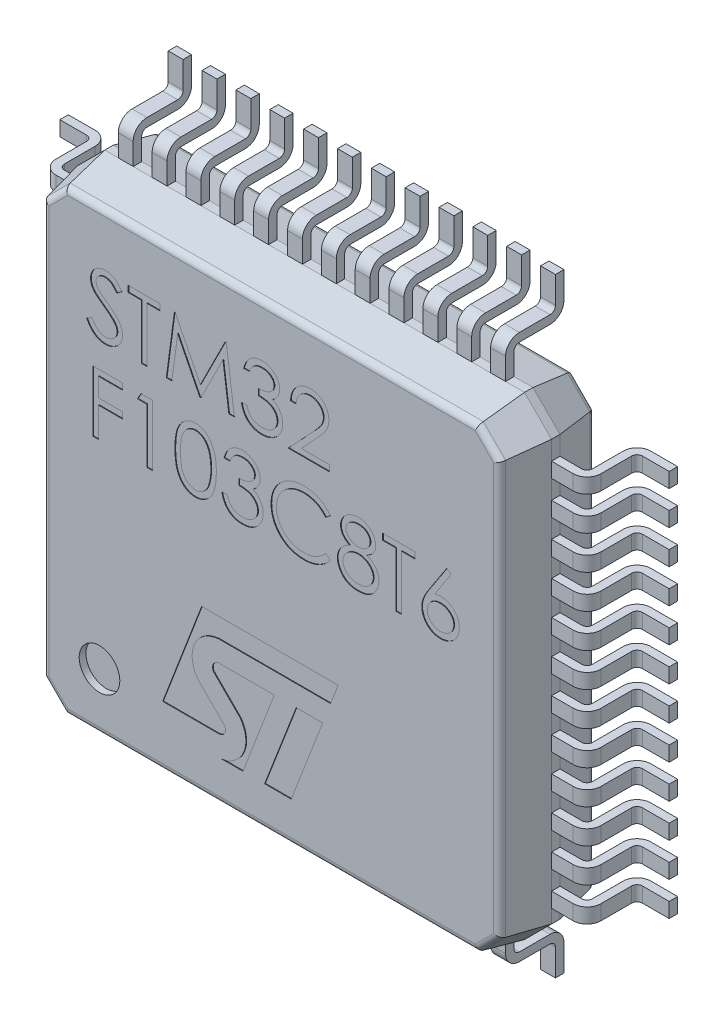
from build123d import *
from OCP.BRepFilletAPI import BRepFilletAPI_MakeChamfer

# Parameters (mm, degrees)
EXTRUDE1_DEPTH     = 1.4
CHAMFER1_SIZE      = 0.6375
CHAMFER1_SIZE2     = 0.135504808
FILLET1_R          = 0.1
SKETCH2_W          = 0.22
SKETCH2_H          = 1
EXTRUDE2_DEPTH     = 0.8625
EXTRUDE3_DEPTH     = 8.902050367
SKETCH4_W          = 1
SKETCH4_H          = 0.22
EXTRUDE4_DEPTH     = 0.8625
EXTRUDE5_DEPTH     = 9.789766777
SKETCH6_R          = 0.3
EXTRUDE6_DEPTH     = 0.1
CUT_EXTRUDE1_DEPTH = 0.01
CUT_EXTRUDE2_DEPTH = 0.01


with BuildPart() as part:
    # Sketch1 → Extrude1 (new body)
    with BuildSketch(Plane.XY.offset(0.1)):
        Polygon((-3.1, 3.5), (-3.5, 3.1), (-3.5, -3.1), (-3.1, -3.5), (3.1, -3.5), (3.5, -3.1), (3.5, 3.1), (3.1, 3.5), align=None)
    extrude(amount=EXTRUDE1_DEPTH)

    # Chamfer1: one chamfer whose edges measure the first distance from different faces: ONE call of the kernel's chamfer builder (chamfer() names one face for all edges)
    chamfer1_edges_1 = [part.edges().sort_by_distance(p)[0] for p in [
        (0, -3.5, 1.5),
        (0, -3.5, 0.1),
    ]]
    chamfer1_side_1 = [part.faces().sort_by_distance(p)[0] for p in [
        (0, -3.5, 0.8),
    ]]
    chamfer1_edges_2 = [part.edges().sort_by_distance(p)[0] for p in [
        (-3.3, -3.3, 0.1),
        (-3.3, -3.3, 1.5),
    ]]
    chamfer1_side_2 = [part.faces().sort_by_distance(p)[0] for p in [
        (-3.3, -3.3, 0.8),
    ]]
    chamfer1_edges_3 = [part.edges().sort_by_distance(p)[0] for p in [
        (-3.5, 0, 0.1),
        (-3.5, 0, 1.5),
    ]]
    chamfer1_side_3 = [part.faces().sort_by_distance(p)[0] for p in [
        (-3.5, 0, 0.8),
    ]]
    chamfer1_edges_4 = [part.edges().sort_by_distance(p)[0] for p in [
        (3.3, -3.3, 1.5),
        (3.3, -3.3, 0.1),
    ]]
    chamfer1_side_4 = [part.faces().sort_by_distance(p)[0] for p in [
        (3.3, -3.3, 0.8),
    ]]
    chamfer1_edges_5 = [part.edges().sort_by_distance(p)[0] for p in [
        (3.5, 0, 1.5),
        (3.5, 0, 0.1),
    ]]
    chamfer1_side_5 = [part.faces().sort_by_distance(p)[0] for p in [
        (3.5, 0, 0.8),
    ]]
    chamfer1_edges_6 = [part.edges().sort_by_distance(p)[0] for p in [
        (3.3, 3.3, 1.5),
        (3.3, 3.3, 0.1),
    ]]
    chamfer1_side_6 = [part.faces().sort_by_distance(p)[0] for p in [
        (3.3, 3.3, 0.8),
    ]]
    chamfer1_edges_7 = [part.edges().sort_by_distance(p)[0] for p in [
        (0, 3.5, 1.5),
        (0, 3.5, 0.1),
    ]]
    chamfer1_side_7 = [part.faces().sort_by_distance(p)[0] for p in [
        (0, 3.5, 0.8),
    ]]
    chamfer1_edges_8 = [part.edges().sort_by_distance(p)[0] for p in [
        (-3.3, 3.3, 1.5),
        (-3.3, 3.3, 0.1),
    ]]
    chamfer1_side_8 = [part.faces().sort_by_distance(p)[0] for p in [
        (-3.3, 3.3, 0.8),
    ]]
    chamfer1 = BRepFilletAPI_MakeChamfer(part.part.solid().wrapped)
    for e in chamfer1_edges_1:
        chamfer1.Add(CHAMFER1_SIZE, CHAMFER1_SIZE2, e.wrapped, chamfer1_side_1[0].wrapped)  # the first distance lies on this face
    for e in chamfer1_edges_2:
        chamfer1.Add(CHAMFER1_SIZE, CHAMFER1_SIZE2, e.wrapped, chamfer1_side_2[0].wrapped)  # the first distance lies on this face
    for e in chamfer1_edges_3:
        chamfer1.Add(CHAMFER1_SIZE, CHAMFER1_SIZE2, e.wrapped, chamfer1_side_3[0].wrapped)  # the first distance lies on this face
    for e in chamfer1_edges_4:
        chamfer1.Add(CHAMFER1_SIZE, CHAMFER1_SIZE2, e.wrapped, chamfer1_side_4[0].wrapped)  # the first distance lies on this face
    for e in chamfer1_edges_5:
        chamfer1.Add(CHAMFER1_SIZE, CHAMFER1_SIZE2, e.wrapped, chamfer1_side_5[0].wrapped)  # the first distance lies on this face
    for e in chamfer1_edges_6:
        chamfer1.Add(CHAMFER1_SIZE, CHAMFER1_SIZE2, e.wrapped, chamfer1_side_6[0].wrapped)  # the first distance lies on this face
    for e in chamfer1_edges_7:
        chamfer1.Add(CHAMFER1_SIZE, CHAMFER1_SIZE2, e.wrapped, chamfer1_side_7[0].wrapped)  # the first distance lies on this face
    for e in chamfer1_edges_8:
        chamfer1.Add(CHAMFER1_SIZE, CHAMFER1_SIZE2, e.wrapped, chamfer1_side_8[0].wrapped)  # the first distance lies on this face
    add(Compound.cast(chamfer1.Shape()), mode=Mode.REPLACE)

    # Fillet1
    fillet1_edges = [part.edges().sort_by_distance(p)[0] for p in [
        (-3.364495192, 0, 0.1),
        (-3.204183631, 3.204183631, 0.1),
        (0, 3.364495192, 0.1),
        (3.204183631, 3.204183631, 0.1),
        (3.364495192, 0, 0.1),
        (3.204183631, -3.204183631, 0.1),
        (0, -3.364495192, 0.1),
        (-3.204183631, -3.204183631, 0.1),
        (-3.364495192, 0, 1.5),
        (-3.204183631, -3.204183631, 1.5),
        (0, -3.364495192, 1.5),
        (3.204183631, -3.204183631, 1.5),
        (3.364495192, 0, 1.5),
        (3.204183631, 3.204183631, 1.5),
        (0, 3.364495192, 1.5),
        (-3.204183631, 3.204183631, 1.5),
    ]]
    fillet(fillet1_edges, radius=FILLET1_R)

    # Sketch2 → Extrude2 (add)
    with BuildSketch(Plane.XY):
        with Locations((2.21, -4)):
            Rectangle(SKETCH2_W, SKETCH2_H)
        with Locations((2.71, -4)):
            Rectangle(SKETCH2_W, SKETCH2_H)
        with Locations((1.71, -4)):
            Rectangle(SKETCH2_W, SKETCH2_H)
        with Locations((1.21, -4)):
            Rectangle(SKETCH2_W, SKETCH2_H)
        with Locations((0.71, -4)):
            Rectangle(SKETCH2_W, SKETCH2_H)
        with Locations((0.21, -4)):
            Rectangle(SKETCH2_W, SKETCH2_H)
        with Locations((-0.29, -4)):
            Rectangle(SKETCH2_W, SKETCH2_H)
        with Locations((-0.79, -4)):
            Rectangle(SKETCH2_W, SKETCH2_H)
        with Locations((-1.29, -4)):
            Rectangle(SKETCH2_W, SKETCH2_H)
        with Locations((-1.79, -4)):
            Rectangle(SKETCH2_W, SKETCH2_H)
        with Locations((-2.29, -4)):
            Rectangle(SKETCH2_W, SKETCH2_H)
        with Locations((-2.79, -4)):
            Rectangle(SKETCH2_W, SKETCH2_H)
    extrude2 = extrude(amount=EXTRUDE2_DEPTH)

    # Sketch3 → Extrude3 (cut, through all)
    with BuildSketch(Plane(origin=(2.82, 0, 0), x_dir=(0, 0, -1), z_dir=(1, 0, 0))):
        with BuildLine():
            Line((-0.6575, -3.9), (-0.205, -3.9))
            ThreePointArc((-0.205, -3.9), (-0.06004311, -3.96004311), (0, -4.105))
            Line((0, -4.105), (0, -3.5))
            Line((0, -3.5), (-0.7375, -3.5))
            Line((-0.7375, -3.5), (-0.7375, -3.82))
            ThreePointArc((-0.7375, -3.82), (-0.714068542, -3.876568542), (-0.6575, -3.9))
        make_face()
        with BuildLine():
            Line((-0.8625, -3.82), (-0.8625, -4.5))
            Line((-0.8625, -4.5), (-0.125, -4.5))
            Line((-0.125, -4.5), (-0.125, -4.105))
            ThreePointArc((-0.125, -4.105), (-0.148431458, -4.048431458), (-0.205, -4.025))
            Line((-0.205, -4.025), (-0.6575, -4.025))
            ThreePointArc((-0.6575, -4.025), (-0.80245689, -3.96495689), (-0.8625, -3.82))
        make_face()
    extrude3 = extrude(amount=-EXTRUDE3_DEPTH, mode=Mode.SUBTRACT)

    # Mirror1: Extrude2, Extrude3 across plane
    add(extrude2.mirror(Plane.ZX))
    add(extrude3.mirror(Plane.ZX), mode=Mode.SUBTRACT)

    # Sketch4 → Extrude4 (add)
    with BuildSketch(Plane.XY):
        with Locations((-4, -2.29)):
            Rectangle(SKETCH4_W, SKETCH4_H)
        with Locations((-4, -1.79)):
            Rectangle(SKETCH4_W, SKETCH4_H)
        with Locations((-4, -1.29)):
            Rectangle(SKETCH4_W, SKETCH4_H)
        with Locations((-4, -0.79)):
            Rectangle(SKETCH4_W, SKETCH4_H)
        with Locations((-4, -0.29)):
            Rectangle(SKETCH4_W, SKETCH4_H)
        with Locations((-4, 0.21)):
            Rectangle(SKETCH4_W, SKETCH4_H)
        with Locations((-4, 0.71)):
            Rectangle(SKETCH4_W, SKETCH4_H)
        with Locations((-4, 1.21)):
            Rectangle(SKETCH4_W, SKETCH4_H)
        with Locations((-4, 1.71)):
            Rectangle(SKETCH4_W, SKETCH4_H)
        with Locations((-4, 2.21)):
            Rectangle(SKETCH4_W, SKETCH4_H)
        with Locations((-4, -2.79)):
            Rectangle(SKETCH4_W, SKETCH4_H)
        with Locations((-4, 2.71)):
            Rectangle(SKETCH4_W, SKETCH4_H)
    extrude4 = extrude(amount=EXTRUDE4_DEPTH)

    # Sketch5 → Extrude5 (cut, through all)
    with BuildSketch(Plane.XZ.offset(2.9)):
        with BuildLine():
            Line((-3.9, 0.6575), (-3.9, 0.205))
            ThreePointArc((-3.9, 0.205), (-3.96004311, 0.06004311), (-4.105, 0))
            Line((-4.105, 0), (-3.5, 0))
            Line((-3.5, 0), (-3.5, 0.7375))
            Line((-3.5, 0.7375), (-3.82, 0.7375))
            ThreePointArc((-3.82, 0.7375), (-3.876568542, 0.714068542), (-3.9, 0.6575))
        make_face()
        with BuildLine():
            Line((-4.5, 0.125), (-4.105, 0.125))
            ThreePointArc((-4.105, 0.125), (-4.048431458, 0.148431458), (-4.025, 0.205))
            Line((-4.025, 0.205), (-4.025, 0.6575))
            ThreePointArc((-4.025, 0.6575), (-3.96495689, 0.80245689), (-3.82, 0.8625))
            Line((-3.82, 0.8625), (-4.5, 0.8625))
            Line((-4.5, 0.8625), (-4.5, 0.125))
        make_face()
    extrude5 = extrude(amount=-EXTRUDE5_DEPTH, mode=Mode.SUBTRACT)

    # Mirror2: Extrude4, Extrude5 across plane
    add(extrude4.mirror(Plane(origin=(0, 0, 0), x_dir=(0, 0, 1), z_dir=(1, 0, 0))))
    add(extrude5.mirror(Plane(origin=(0, 0, 0), x_dir=(0, 0, 1), z_dir=(1, 0, 0))), mode=Mode.SUBTRACT)

    # Sketch6 → Extrude6 (cut)
    with BuildSketch(Plane.XY.offset(1.5)):
        with Locations((-2.54, -2.54)):
            Circle(SKETCH6_R)
    extrude(amount=-EXTRUDE6_DEPTH, mode=Mode.SUBTRACT)

    # Sketch7 → Cut-Extrude1 (cut)
    with BuildSketch(Plane.XY.offset(1.5)):
        with BuildLine():
            Line((0.984990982, -0.984514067), (-1.030781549, -0.984514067))
            Line((-1.030781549, -0.984514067), (-1.606083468, -2.486556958))
            Line((-1.606083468, -2.486556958), (-0.778215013, -2.486556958))
            add(Edge.make_bspline(
                [(-0.778215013, -2.486556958), (-0.744994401, -2.486547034), (-0.696054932, -2.459787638), (-0.675199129, -2.390640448), (-0.683271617, -2.352639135), (-0.697392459, -2.334498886)],
                knots=[0, 0, 0, 0, 0.478706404, 0.677313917, 1, 1, 1, 1], degree=3))
            Line((-0.697392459, -2.334498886), (-1.065593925, -1.96629742))
            add(Edge.make_bspline(
                [(-1.065593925, -1.96629742), (-1.10629603, -1.923497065), (-1.15147085, -1.84101704), (-1.17664781, -1.697147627), (-1.164698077, -1.572983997), (-1.10800273, -1.457707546), (-1.017078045, -1.350892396), (-0.894506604, -1.291804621), (-0.804285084, -1.277010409), (-0.778215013, -1.273833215)],
                knots=[0, 0, 0, 0, 0.189829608, 0.294521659, 0.468645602, 0.580629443, 0.704401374, 0.91547922, 1, 1, 1, 1], degree=3))
            Line((-0.778215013, -1.273833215), (0.87438568, -1.273833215))
            Line((0.87438568, -1.273833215), (0.984990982, -0.984514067))
        make_face()
        with BuildLine():
            Line((-0.421246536, -2.787592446), (0.042974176, -1.581600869))
            Line((0.042974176, -1.581600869), (-0.770837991, -1.581600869))
            add(Edge.make_bspline(
                [(-0.770837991, -1.581600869), (-0.79196663, -1.580604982), (-0.832053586, -1.593927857), (-0.874926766, -1.653492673), (-0.869153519, -1.705811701), (-0.855566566, -1.731862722)],
                knots=[0, 0, 0, 0, 0.305418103, 0.574312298, 1, 1, 1, 1], degree=3))
            Line((-0.855566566, -1.731862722), (-0.457321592, -2.130107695))
            add(Edge.make_bspline(
                [(-0.457321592, -2.130107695), (-0.41917316, -2.186013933), (-0.376873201, -2.288839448), (-0.375158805, -2.443231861), (-0.414594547, -2.568809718), (-0.49071721, -2.669151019), (-0.597052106, -2.751486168), (-0.682489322, -2.784421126), (-0.736895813, -2.787592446)],
                knots=[0, 0, 0, 0, 0.236780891, 0.378149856, 0.532395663, 0.688335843, 0.810694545, 1, 1, 1, 1], degree=3))
            Line((-0.736895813, -2.787592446), (-0.421246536, -2.787592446))
        make_face()
        Polygon((0.366251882, -1.581600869), (0.757676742, -1.581600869), (0.291796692, -2.787592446), (-0.100366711, -2.787592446), align=None)
    extrude(amount=-CUT_EXTRUDE1_DEPTH, mode=Mode.SUBTRACT)

    # Sketch8 → Cut-Extrude2 (cut)
    # profile 1 of 13: a face of its own
    with BuildSketch(Plane.XY.offset(1.5)):
        with BuildLine():
            Line((-2.729140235, 1.854188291), (-2.653058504, 1.899801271))
            add(Edge.make_bspline(
                [(-2.653058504, 1.899801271), (-2.645982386, 1.887956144), (-2.632424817, 1.865261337), (-2.609808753, 1.834594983), (-2.586374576, 1.808530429), (-2.561948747, 1.787219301), (-2.536680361, 1.770441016), (-2.510404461, 1.758560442), (-2.483209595, 1.75115062), (-2.464702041, 1.750250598), (-2.45546235, 1.749801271)],
                knots=[0, 0, 0, 0, 1.272034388, 2.437168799, 3.508375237, 4.49857839, 5.41946034, 6.295179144, 7.148887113, 8, 8, 8, 8], degree=3))
            add(Edge.make_bspline(
                [(-2.45546235, 1.749801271), (-2.447571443, 1.750021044), (-2.431927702, 1.750456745), (-2.408897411, 1.754643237), (-2.386530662, 1.761074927), (-2.36528844, 1.770286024), (-2.345463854, 1.781430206), (-2.328079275, 1.794890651), (-2.313050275, 1.809960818), (-2.300756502, 1.826773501), (-2.291324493, 1.844855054), (-2.284075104, 1.863414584), (-2.280052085, 1.882743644), (-2.279446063, 1.895757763), (-2.279140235, 1.90232531)],
                knots=[0, 0, 0, 0, 1.095163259, 2.171163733, 3.241058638, 4.321873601, 5.38011039, 6.391990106, 7.366004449, 8.327778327, 9.272591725, 10.192022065, 11.087607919, 12, 12, 12, 12], degree=3))
            add(Edge.make_bspline(
                [(-2.279140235, 1.90232531), (-2.279519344, 1.909818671), (-2.280290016, 1.92505158), (-2.286803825, 1.947525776), (-2.297050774, 1.969766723), (-2.306504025, 1.983524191), (-2.31141187, 1.990666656)],
                knots=[0, 0, 0, 0, 0.938893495, 1.908633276, 2.914225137, 4, 4, 4, 4], degree=3))
            add(Edge.make_bspline(
                [(-2.31141187, 1.990666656), (-2.315441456, 1.995821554), (-2.323901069, 2.006643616), (-2.338444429, 2.022752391), (-2.355510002, 2.039368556), (-2.374513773, 2.057126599), (-2.396147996, 2.075200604), (-2.419735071, 2.094452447), (-2.445877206, 2.114149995), (-2.464211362, 2.127360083), (-2.473671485, 2.134176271)],
                knots=[0, 0, 0, 0, 0.722233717, 1.516239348, 2.393582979, 3.351407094, 4.387010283, 5.505090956, 6.712668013, 8, 8, 8, 8], degree=3))
            add(Edge.make_bspline(
                [(-2.473671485, 2.134176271), (-2.483140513, 2.140920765), (-2.501244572, 2.153815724), (-2.526562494, 2.172953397), (-2.549202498, 2.190450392), (-2.56906396, 2.206471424), (-2.586138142, 2.221018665), (-2.60055959, 2.233952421), (-2.611960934, 2.245622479), (-2.61830094, 2.25319311), (-2.621147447, 2.256592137)],
                knots=[0, 0, 0, 0, 1.452282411, 2.77665338, 3.964542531, 5.026858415, 5.96415736, 6.766646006, 7.446254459, 8, 8, 8, 8], degree=3))
            add(Edge.make_bspline(
                [(-2.621147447, 2.256592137), (-2.625126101, 2.261889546), (-2.632950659, 2.272307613), (-2.643279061, 2.288591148), (-2.652057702, 2.305259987), (-2.658939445, 2.322358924), (-2.664734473, 2.339647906), (-2.668632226, 2.357352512), (-2.671072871, 2.375393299), (-2.671322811, 2.387533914), (-2.671447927, 2.393611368)],
                knots=[0, 0, 0, 0, 1.068054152, 2.10047183, 3.106115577, 4.101338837, 5.06977816, 6.043150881, 7.020423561, 8, 8, 8, 8], degree=3))
            add(Edge.make_bspline(
                [(-2.671447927, 2.393611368), (-2.671112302, 2.40313331), (-2.670448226, 2.421973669), (-2.664832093, 2.449495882), (-2.655967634, 2.47577239), (-2.643548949, 2.500543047), (-2.627539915, 2.523162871), (-2.609013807, 2.543892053), (-2.586947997, 2.56131826), (-2.562737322, 2.576544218), (-2.536237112, 2.588461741), (-2.508468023, 2.597451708), (-2.479385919, 2.602545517), (-2.45968797, 2.603276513), (-2.44969312, 2.603647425)],
                knots=[0, 0, 0, 0, 1.005424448, 1.989358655, 2.955360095, 3.929531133, 4.905563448, 5.876582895, 6.856512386, 7.866279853, 8.892233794, 9.918561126, 10.94386622, 12, 12, 12, 12], degree=3))
            add(Edge.make_bspline(
                [(-2.44969312, 2.603647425), (-2.439087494, 2.603281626), (-2.417996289, 2.602554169), (-2.386972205, 2.596229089), (-2.357102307, 2.585763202), (-2.333074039, 2.573886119), (-2.314268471, 2.562023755), (-2.299926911, 2.551218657), (-2.285393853, 2.538779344), (-2.270552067, 2.52467268), (-2.25565304, 2.50876923), (-2.240475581, 2.49117791), (-2.224984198, 2.472006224), (-2.215018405, 2.458319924), (-2.209909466, 2.451303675)],
                knots=[0, 0, 0, 0, 1.286793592, 2.559021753, 3.825965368, 5.121522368, 5.803751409, 6.523245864, 7.299691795, 8.125521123, 9.008227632, 9.944561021, 10.946284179, 12, 12, 12, 12], degree=3))
            Line((-2.209909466, 2.451303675), (-2.282926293, 2.395955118))
            add(Edge.make_bspline(
                [(-2.282926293, 2.395955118), (-2.287335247, 2.401635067), (-2.295825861, 2.41257332), (-2.308716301, 2.427891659), (-2.320865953, 2.441884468), (-2.332836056, 2.454038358), (-2.343994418, 2.465018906), (-2.354824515, 2.474419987), (-2.365170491, 2.482333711), (-2.378211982, 2.490779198), (-2.394596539, 2.49915087), (-2.415163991, 2.506234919), (-2.436657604, 2.510491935), (-2.451296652, 2.511054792), (-2.458707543, 2.511339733)],
                knots=[0, 0, 0, 0, 1.181633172, 2.275549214, 3.290209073, 4.226197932, 5.078386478, 5.862611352, 6.581680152, 7.217281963, 8.414376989, 9.595101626, 10.782541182, 12, 12, 12, 12], degree=3))
            add(Edge.make_bspline(
                [(-2.458707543, 2.511339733), (-2.468004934, 2.511028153), (-2.485934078, 2.5104273), (-2.51138871, 2.503865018), (-2.534298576, 2.49353254), (-2.553983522, 2.479051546), (-2.57037303, 2.461894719), (-2.58222872, 2.442151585), (-2.589364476, 2.420350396), (-2.590235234, 2.405142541), (-2.590678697, 2.397397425)],
                knots=[0, 0, 0, 0, 1.14458467, 2.207223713, 3.21896685, 4.227309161, 5.202851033, 6.127160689, 7.046193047, 8, 8, 8, 8], degree=3))
            add(Edge.make_bspline(
                [(-2.590678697, 2.397397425), (-2.590577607, 2.392575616), (-2.590375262, 2.382924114), (-2.587553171, 2.368665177), (-2.58392763, 2.354442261), (-2.578182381, 2.340319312), (-2.570250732, 2.326049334), (-2.559835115, 2.311386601), (-2.546717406, 2.296201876), (-2.536669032, 2.286325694), (-2.531363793, 2.281111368)],
                knots=[0, 0, 0, 0, 0.858281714, 1.717966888, 2.583508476, 3.4729293, 4.427298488, 5.488583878, 6.674047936, 8, 8, 8, 8], degree=3))
            add(Edge.make_bspline(
                [(-2.531363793, 2.281111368), (-2.529393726, 2.279353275), (-2.524713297, 2.27517645), (-2.51615663, 2.268338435), (-2.504857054, 2.259903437), (-2.49110963, 2.249466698), (-2.47466088, 2.237360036), (-2.455508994, 2.22373825), (-2.433867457, 2.208159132), (-2.418510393, 2.197267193), (-2.410390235, 2.191508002)],
                knots=[0, 0, 0, 0, 0.420754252, 0.999615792, 1.744751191, 2.668019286, 3.750313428, 4.999500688, 6.413464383, 8, 8, 8, 8], degree=3))
            add(Edge.make_bspline(
                [(-2.410390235, 2.191508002), (-2.400622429, 2.184400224), (-2.381708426, 2.170636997), (-2.354796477, 2.149958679), (-2.330395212, 2.129734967), (-2.308418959, 2.110095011), (-2.288650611, 2.091187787), (-2.271309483, 2.072785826), (-2.25621888, 2.055020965), (-2.239972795, 2.03224516), (-2.223372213, 2.004272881), (-2.209115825, 1.970001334), (-2.200126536, 1.935596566), (-2.198951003, 1.912472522), (-2.198371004, 1.901063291)],
                knots=[0, 0, 0, 0, 1.163667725, 2.253281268, 3.268753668, 4.215851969, 5.092017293, 5.902905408, 6.650798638, 7.335211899, 8.59617414, 9.77448103, 10.901945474, 12, 12, 12, 12], degree=3))
            add(Edge.make_bspline(
                [(-2.198371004, 1.901063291), (-2.198539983, 1.892994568), (-2.198874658, 1.877013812), (-2.20272175, 1.853548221), (-2.208358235, 1.830757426), (-2.216853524, 1.80892314), (-2.227222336, 1.787645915), (-2.240379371, 1.767483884), (-2.255629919, 1.74799081), (-2.273124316, 1.729686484), (-2.292267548, 1.712883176), (-2.312500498, 1.697935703), (-2.333856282, 1.68547242), (-2.356219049, 1.675302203), (-2.379593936, 1.66734787), (-2.40397308, 1.661584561), (-2.429396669, 1.658047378), (-2.446676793, 1.65768024), (-2.45546235, 1.657493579)],
                knots=[0, 0, 0, 0, 0.983748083, 1.948392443, 2.894712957, 3.844097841, 4.80183111, 5.778335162, 6.776009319, 7.81870978, 8.863265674, 9.881300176, 10.883814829, 11.87499822, 12.874611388, 13.892143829, 14.928324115, 16, 16, 16, 16], degree=3))
            add(Edge.make_bspline(
                [(-2.45546235, 1.657493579), (-2.46226001, 1.657625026), (-2.47576972, 1.657886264), (-2.495752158, 1.660195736), (-2.515330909, 1.663463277), (-2.534260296, 1.668650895), (-2.552784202, 1.674944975), (-2.570822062, 1.682694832), (-2.588382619, 1.691982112), (-2.605564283, 1.702600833), (-2.622323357, 1.714958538), (-2.638502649, 1.729351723), (-2.654633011, 1.745383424), (-2.670238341, 1.763488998), (-2.685634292, 1.783375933), (-2.700517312, 1.805230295), (-2.715195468, 1.828933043), (-2.72440516, 1.845612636), (-2.729140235, 1.854188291)],
                knots=[0, 0, 0, 0, 0.915332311, 1.819136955, 2.706846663, 3.586547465, 4.459518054, 5.340707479, 6.227863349, 7.133153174, 8.059268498, 9.028702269, 10.047606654, 11.120612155, 12.245963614, 13.433783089, 14.680604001, 16, 16, 16, 16], degree=3))
        make_face()
    # profile 2 of 13: a face of its own
    with BuildSketch(Plane.XY.offset(1.5)):
        Polygon((-2.117601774, 2.48826281), (-2.117601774, 2.580570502), (-1.64452485, 2.580570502), (-1.64452485, 2.48826281), (-1.840678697, 2.48826281), (-1.840678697, 1.680570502), (-1.921447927, 1.680570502), (-1.921447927, 2.48826281), align=None)
    # profile 3 of 13: a face of its own
    with BuildSketch(Plane.XY.offset(1.5)):
        Polygon((-1.552217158, 1.680570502), (-1.433407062, 2.580570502), (-1.4218686, 2.580570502), (-1.050294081, 1.842108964), (-0.679621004, 2.580570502), (-0.667902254, 2.580570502), (-0.548371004, 1.680570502), (-0.629500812, 1.680570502), (-0.715678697, 2.328166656), (-1.040558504, 1.680570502), (-1.058767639, 1.680570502), (-1.384909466, 2.329608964), (-1.470907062, 1.680570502), align=None)
    # profile 4 of 13: a face of its own
    with BuildSketch(Plane.XY.offset(1.5)):
        with BuildLine():
            Line((-0.329140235, 2.372878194), (-0.409909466, 2.372878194))
            add(Edge.make_bspline(
                [(-0.409909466, 2.372878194), (-0.407721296, 2.381937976), (-0.403443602, 2.399649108), (-0.394521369, 2.424953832), (-0.38480156, 2.448899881), (-0.373130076, 2.471038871), (-0.360399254, 2.491815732), (-0.345813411, 2.510759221), (-0.330045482, 2.528351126), (-0.312604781, 2.543963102), (-0.294314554, 2.558100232), (-0.27491708, 2.570153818), (-0.254802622, 2.580522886), (-0.233831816, 2.589065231), (-0.211942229, 2.595500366), (-0.189331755, 2.600169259), (-0.16594114, 2.60320126), (-0.150063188, 2.60349717), (-0.142000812, 2.603647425)],
                knots=[0, 0, 0, 0, 1.162005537, 2.271625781, 3.343758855, 4.383309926, 5.390229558, 6.379919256, 7.361854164, 8.333198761, 9.295911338, 10.242430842, 11.177959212, 12.116337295, 13.062827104, 14.020064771, 14.994644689, 16, 16, 16, 16], degree=3))
            add(Edge.make_bspline(
                [(-0.142000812, 2.603647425), (-0.130253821, 2.603292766), (-0.107016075, 2.602591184), (-0.072877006, 2.596184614), (-0.039955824, 2.586046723), (-0.008612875, 2.572039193), (0.020500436, 2.554762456), (0.046404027, 2.534200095), (0.068746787, 2.510748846), (0.087491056, 2.484846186), (0.102167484, 2.457163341), (0.112989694, 2.428671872), (0.119578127, 2.399439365), (0.120431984, 2.379701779), (0.120859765, 2.369813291)],
                knots=[0, 0, 0, 0, 1.083050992, 2.142477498, 3.193116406, 4.255571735, 5.30263384, 6.308962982, 7.297363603, 8.282367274, 9.249857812, 10.179914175, 11.08814088, 12, 12, 12, 12], degree=3))
            add(Edge.make_bspline(
                [(0.120859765, 2.369813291), (0.120560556, 2.360297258), (0.11997505, 2.341675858), (0.115003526, 2.31449033), (0.106637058, 2.288868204), (0.095047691, 2.26470162), (0.080045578, 2.242143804), (0.061872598, 2.221144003), (0.040400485, 2.201609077), (0.024128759, 2.190418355), (0.015751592, 2.184657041)],
                knots=[0, 0, 0, 0, 1.024540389, 2.004866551, 2.965041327, 3.920577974, 4.882998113, 5.874504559, 6.905732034, 8, 8, 8, 8], degree=3))
            add(Edge.make_bspline(
                [(0.015751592, 2.184657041), (0.025325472, 2.180034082), (0.044294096, 2.170874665), (0.070149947, 2.152911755), (0.093621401, 2.132171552), (0.106710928, 2.115986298), (0.11328765, 2.107854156)],
                knots=[0, 0, 0, 0, 1.015518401, 2.012035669, 3.001164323, 4, 4, 4, 4], degree=3))
            add(Edge.make_bspline(
                [(0.11328765, 2.107854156), (0.11761828, 2.10192502), (0.126208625, 2.090163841), (0.136812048, 2.071254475), (0.146431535, 2.05213552), (0.153927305, 2.03229453), (0.159732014, 2.01196147), (0.163881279, 1.991101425), (0.166458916, 1.969697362), (0.166828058, 1.95521701), (0.167013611, 1.947938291)],
                knots=[0, 0, 0, 0, 1.025084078, 2.033381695, 3.024893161, 4.013698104, 4.991890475, 5.976764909, 6.982997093, 8, 8, 8, 8], degree=3))
            add(Edge.make_bspline(
                [(0.167013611, 1.947938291), (0.166552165, 1.935335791), (0.165631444, 1.910190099), (0.157401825, 1.873039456), (0.144644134, 1.836724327), (0.126526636, 1.801990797), (0.10444642, 1.769492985), (0.078177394, 1.74041622), (0.048018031, 1.715422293), (0.014382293, 1.694539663), (-0.022059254, 1.677846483), (-0.061035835, 1.666260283), (-0.101985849, 1.658714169), (-0.130067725, 1.657904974), (-0.144344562, 1.657493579)],
                knots=[0, 0, 0, 0, 0.955779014, 1.907060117, 2.875433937, 3.871313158, 4.872415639, 5.851225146, 6.836215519, 7.83643374, 8.849228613, 9.86973379, 10.916971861, 12, 12, 12, 12], degree=3))
            add(Edge.make_bspline(
                [(-0.144344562, 1.657493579), (-0.153966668, 1.657716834), (-0.172899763, 1.658156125), (-0.200733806, 1.661159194), (-0.227302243, 1.666644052), (-0.252640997, 1.674024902), (-0.276772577, 1.683382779), (-0.299623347, 1.695036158), (-0.321333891, 1.70874483), (-0.341699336, 1.72467061), (-0.360717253, 1.742485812), (-0.377882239, 1.7625067), (-0.393480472, 1.784363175), (-0.407094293, 1.808309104), (-0.419343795, 1.834035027), (-0.429418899, 1.861870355), (-0.438286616, 1.891566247), (-0.442409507, 1.912260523), (-0.44452485, 1.922878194)],
                knots=[0, 0, 0, 0, 1.048658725, 2.063410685, 3.046034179, 4.001477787, 4.936774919, 5.862367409, 6.792675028, 7.730719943, 8.675894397, 9.627829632, 10.600096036, 11.597688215, 12.626045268, 13.701542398, 14.82072376, 16, 16, 16, 16], degree=3))
            Line((-0.44452485, 1.922878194), (-0.36375562, 1.922878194))
            add(Edge.make_bspline(
                [(-0.36375562, 1.922878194), (-0.361651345, 1.915948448), (-0.357558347, 1.90246949), (-0.350591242, 1.883070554), (-0.342653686, 1.865287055), (-0.334138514, 1.848988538), (-0.325195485, 1.834014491), (-0.31518879, 1.820760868), (-0.304859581, 1.80864553), (-0.297073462, 1.801819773), (-0.293262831, 1.798479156)],
                knots=[0, 0, 0, 0, 1.198163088, 2.33053128, 3.407730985, 4.417276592, 5.372219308, 6.28897303, 7.162600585, 8, 8, 8, 8], degree=3))
            add(Edge.make_bspline(
                [(-0.293262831, 1.798479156), (-0.288223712, 1.794594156), (-0.278161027, 1.786836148), (-0.261763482, 1.776935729), (-0.244518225, 1.76835718), (-0.226051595, 1.761804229), (-0.206762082, 1.756255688), (-0.186337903, 1.752624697), (-0.164959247, 1.750133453), (-0.150361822, 1.749913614), (-0.142902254, 1.749801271)],
                knots=[0, 0, 0, 0, 0.946170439, 1.889420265, 2.845303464, 3.807233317, 4.801018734, 5.828864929, 6.890507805, 8, 8, 8, 8], degree=3))
            add(Edge.make_bspline(
                [(-0.142902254, 1.749801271), (-0.134479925, 1.749959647), (-0.118010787, 1.750269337), (-0.093979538, 1.753117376), (-0.071117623, 1.757265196), (-0.04967887, 1.763671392), (-0.029382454, 1.771586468), (-0.010512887, 1.78152463), (0.00717754, 1.793184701), (0.023462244, 1.806437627), (0.038105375, 1.820946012), (0.050998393, 1.836120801), (0.06195902, 1.851898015), (0.070800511, 1.86836496), (0.077782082, 1.885453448), (0.082534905, 1.903211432), (0.08583958, 1.921493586), (0.086108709, 1.933921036), (0.08624438, 1.940185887)],
                knots=[0, 0, 0, 0, 1.217147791, 2.380027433, 3.494444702, 4.572153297, 5.609568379, 6.639424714, 7.649109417, 8.668170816, 9.669597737, 10.625200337, 11.543417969, 12.441394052, 13.322311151, 14.205496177, 15.095365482, 16, 16, 16, 16], degree=3))
            add(Edge.make_bspline(
                [(0.08624438, 1.940185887), (0.085850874, 1.94857166), (0.08506582, 1.965301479), (0.079072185, 1.989914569), (0.06921362, 2.013629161), (0.055412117, 2.03604065), (0.038611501, 2.056811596), (0.018974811, 2.075344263), (-0.003661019, 2.090636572), (-0.0244947, 2.101202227), (-0.042948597, 2.10841176), (-0.058741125, 2.113213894), (-0.076421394, 2.117280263), (-0.095775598, 2.121063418), (-0.116949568, 2.124283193), (-0.139920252, 2.126968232), (-0.164692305, 2.129116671), (-0.181841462, 2.130076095), (-0.190678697, 2.130570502)],
                knots=[0, 0, 0, 0, 1.07054697, 2.135767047, 3.216561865, 4.33974944, 5.486079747, 6.621378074, 7.775625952, 8.963672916, 9.598146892, 10.304877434, 11.070270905, 11.915000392, 12.823868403, 13.805723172, 14.86925407, 16, 16, 16, 16], degree=3))
            Line((-0.190678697, 2.130570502), (-0.190678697, 2.222878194))
            add(Edge.make_bspline(
                [(-0.190678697, 2.222878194), (-0.179544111, 2.223067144), (-0.157734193, 2.22343725), (-0.125875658, 2.227913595), (-0.095411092, 2.234105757), (-0.067015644, 2.24359052), (-0.041134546, 2.254606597), (-0.018680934, 2.267425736), (3.0618e-05, 2.281675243), (0.014909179, 2.297575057), (0.026102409, 2.314627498), (0.034286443, 2.332400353), (0.039120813, 2.351049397), (0.039766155, 2.363776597), (0.040090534, 2.370173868)],
                knots=[0, 0, 0, 0, 1.321986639, 2.589447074, 3.816329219, 5.01088745, 6.139805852, 7.153945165, 8.075214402, 8.924034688, 9.728124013, 10.488707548, 11.240355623, 12, 12, 12, 12], degree=3))
            add(Edge.make_bspline(
                [(0.040090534, 2.370173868), (0.039983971, 2.374873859), (0.03977197, 2.38422427), (0.037098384, 2.397885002), (0.033080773, 2.411128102), (0.027557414, 2.423897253), (0.020164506, 2.436103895), (0.011317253, 2.447852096), (0.000782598, 2.459074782), (-0.011289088, 2.469535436), (-0.024252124, 2.479504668), (-0.038459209, 2.487968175), (-0.053481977, 2.495205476), (-0.069337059, 2.501173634), (-0.08607591, 2.505663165), (-0.103619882, 2.508886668), (-0.122002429, 2.510902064), (-0.134543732, 2.511192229), (-0.140919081, 2.511339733)],
                knots=[0, 0, 0, 0, 0.884392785, 1.759457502, 2.611959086, 3.489218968, 4.37281399, 5.2945488, 6.255912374, 7.266815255, 8.301784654, 9.332968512, 10.37626691, 11.440494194, 12.520033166, 13.637162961, 14.798855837, 16, 16, 16, 16], degree=3))
            add(Edge.make_bspline(
                [(-0.140919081, 2.511339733), (-0.151166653, 2.510981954), (-0.171182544, 2.510283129), (-0.200037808, 2.504162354), (-0.22686278, 2.494396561), (-0.247367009, 2.482739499), (-0.262508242, 2.471232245), (-0.273328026, 2.461182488), (-0.2839533, 2.450014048), (-0.293685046, 2.437039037), (-0.303526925, 2.423136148), (-0.312486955, 2.40759863), (-0.321193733, 2.390831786), (-0.326440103, 2.378978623), (-0.329140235, 2.372878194)],
                knots=[0, 0, 0, 0, 1.472543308, 2.876219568, 4.221790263, 5.565193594, 6.249813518, 6.953379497, 7.687249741, 8.463570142, 9.283606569, 10.136032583, 11.040678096, 12, 12, 12, 12], degree=3))
        make_face()
    # profile 5 of 13: a face of its own
    with BuildSketch(Plane.XY.offset(1.5)):
        with BuildLine():
            Line((0.363167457, 2.303647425), (0.282398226, 2.303647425))
            add(Edge.make_bspline(
                [(0.282398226, 2.303647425), (0.282924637, 2.314362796), (0.283958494, 2.3354075), (0.288800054, 2.36609079), (0.295727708, 2.395419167), (0.305522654, 2.423157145), (0.317687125, 2.449549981), (0.332274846, 2.474492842), (0.349553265, 2.497890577), (0.369149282, 2.519526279), (0.390432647, 2.539374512), (0.413397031, 2.556514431), (0.43752861, 2.570996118), (0.462754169, 2.583102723), (0.489358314, 2.592190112), (0.51709962, 2.598932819), (0.54609997, 2.602989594), (0.565858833, 2.603425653), (0.575907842, 2.603647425)],
                knots=[0, 0, 0, 0, 1.10065271, 2.161652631, 3.183658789, 4.190468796, 5.17591951, 6.163126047, 7.15150782, 8.156236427, 9.156009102, 10.134482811, 11.092018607, 12.041330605, 13.001268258, 13.972401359, 14.968799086, 16, 16, 16, 16], degree=3))
            add(Edge.make_bspline(
                [(0.575907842, 2.603647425), (0.585776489, 2.603416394), (0.60516803, 2.602962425), (0.63346969, 2.599063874), (0.660412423, 2.592957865), (0.685943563, 2.584391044), (0.709859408, 2.572875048), (0.73233962, 2.559041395), (0.753651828, 2.54304201), (0.77283643, 2.524205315), (0.790452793, 2.504096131), (0.805650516, 2.482627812), (0.818665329, 2.460454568), (0.82951359, 2.437407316), (0.837499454, 2.413269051), (0.843562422, 2.388391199), (0.846989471, 2.362516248), (0.847515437, 2.345003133), (0.847782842, 2.336099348)],
                knots=[0, 0, 0, 0, 1.111607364, 2.184268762, 3.212621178, 4.221274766, 5.211760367, 6.196651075, 7.1921475, 8.207485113, 9.220403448, 10.201281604, 11.166441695, 12.114753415, 13.065576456, 14.026450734, 14.996634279, 16, 16, 16, 16], degree=3))
            add(Edge.make_bspline(
                [(0.847782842, 2.336099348), (0.847347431, 2.323564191), (0.846484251, 2.29871385), (0.839100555, 2.262195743), (0.827568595, 2.226814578), (0.81368356, 2.198339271), (0.79967636, 2.175393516), (0.787053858, 2.156501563), (0.772277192, 2.136160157), (0.755131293, 2.114437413), (0.73597084, 2.09116318), (0.714622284, 2.066351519), (0.690933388, 2.040258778), (0.674306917, 2.022437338), (0.665691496, 2.013202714)],
                knots=[0, 0, 0, 0, 1.184426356, 2.348067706, 3.509069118, 4.696110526, 5.333549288, 6.050745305, 6.844228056, 7.710549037, 8.667450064, 9.695053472, 10.805634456, 12, 12, 12, 12], degree=3))
            Line((0.665691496, 2.013202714), (0.440511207, 1.772878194))
            Line((0.440511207, 1.772878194), (0.859321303, 1.772878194))
            Line((0.859321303, 1.772878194), (0.859321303, 1.680570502))
            Line((0.859321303, 1.680570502), (0.247782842, 1.680570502))
            Line((0.247782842, 1.680570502), (0.596821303, 2.053046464))
            add(Edge.make_bspline(
                [(0.596821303, 2.053046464), (0.605319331, 2.061917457), (0.621642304, 2.078956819), (0.644729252, 2.10383358), (0.665464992, 2.126912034), (0.68398375, 2.148148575), (0.699883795, 2.167853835), (0.713993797, 2.185389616), (0.725299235, 2.201526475), (0.737568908, 2.220231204), (0.749452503, 2.243068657), (0.759664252, 2.27097732), (0.765890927, 2.299707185), (0.766637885, 2.319121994), (0.767013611, 2.32888781)],
                knots=[0, 0, 0, 0, 1.329631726, 2.553950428, 3.673215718, 4.687767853, 5.603093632, 6.413772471, 7.123043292, 7.734684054, 8.834405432, 9.900288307, 10.943827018, 12, 12, 12, 12], degree=3))
            add(Edge.make_bspline(
                [(0.767013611, 2.32888781), (0.766850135, 2.335028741), (0.766527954, 2.347131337), (0.763684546, 2.364875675), (0.759387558, 2.381992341), (0.753230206, 2.398533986), (0.745102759, 2.414334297), (0.735209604, 2.429412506), (0.723795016, 2.443989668), (0.710590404, 2.457657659), (0.696084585, 2.470175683), (0.680760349, 2.481264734), (0.664547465, 2.490531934), (0.647514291, 2.498128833), (0.629708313, 2.504088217), (0.611095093, 2.508217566), (0.59172606, 2.510810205), (0.578500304, 2.511160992), (0.571761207, 2.511339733)],
                knots=[0, 0, 0, 0, 0.991446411, 1.95395049, 2.89581595, 3.838931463, 4.798493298, 5.75982156, 6.748411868, 7.785213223, 8.824556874, 9.840280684, 10.836137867, 11.835679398, 12.848801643, 13.863922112, 14.911575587, 16, 16, 16, 16], degree=3))
            add(Edge.make_bspline(
                [(0.571761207, 2.511339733), (0.564722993, 2.511155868), (0.550901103, 2.510794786), (0.530607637, 2.508268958), (0.511248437, 2.503911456), (0.492774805, 2.49795174), (0.475155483, 2.490376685), (0.458476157, 2.480941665), (0.442774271, 2.469683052), (0.428020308, 2.456918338), (0.414426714, 2.442706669), (0.402483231, 2.426864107), (0.392047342, 2.409679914), (0.38294211, 2.391200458), (0.37554779, 2.371258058), (0.369897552, 2.349923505), (0.365426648, 2.327289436), (0.363933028, 2.311658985), (0.363167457, 2.303647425)],
                knots=[0, 0, 0, 0, 1.031018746, 2.02475058, 2.990194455, 3.934040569, 4.864654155, 5.795059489, 6.735614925, 7.690564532, 8.649604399, 9.611025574, 10.590972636, 11.591080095, 12.624614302, 13.701020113, 14.821632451, 16, 16, 16, 16], degree=3))
        make_face()
    # profile 6 of 13: a face of its own
    with BuildSketch(Plane.XY.offset(1.5)):
        Polygon((-2.636832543, 1.28996707), (-2.198371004, 1.28996707), (-2.198371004, 1.197659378), (-2.556063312, 1.197659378), (-2.556063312, 0.920736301), (-2.198371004, 0.920736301), (-2.198371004, 0.828428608), (-2.556063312, 0.828428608), (-2.556063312, 0.38996707), (-2.636832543, 0.38996707), align=None)
    # profile 7 of 13: a face of its own
    with BuildSketch(Plane.XY.offset(1.5)):
        Polygon((-1.926315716, 1.28996707), (-1.759909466, 1.28996707), (-1.759909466, 0.38996707), (-1.840678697, 0.38996707), (-1.840678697, 1.197659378), (-1.979140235, 1.197659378), align=None)
    # profile 8 of 13: a face of its own
    with BuildSketch(Plane.XY.offset(1.5)):
        with BuildLine():
            add(Edge.make_bspline(
                [(-1.425294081, 0.839606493), (-1.425209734, 0.854031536), (-1.425045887, 0.882052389), (-1.423223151, 0.922882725), (-1.420195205, 0.9611868), (-1.416045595, 0.996966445), (-1.410995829, 1.030230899), (-1.404254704, 1.060891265), (-1.396588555, 1.08908945), (-1.38770364, 1.114917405), (-1.377678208, 1.1387231), (-1.366766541, 1.160946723), (-1.354535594, 1.181554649), (-1.341684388, 1.200875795), (-1.327692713, 1.218593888), (-1.312958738, 1.234959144), (-1.296907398, 1.249593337), (-1.280084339, 1.262925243), (-1.262337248, 1.27461225), (-1.244171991, 1.284906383), (-1.225463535, 1.293700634), (-1.206160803, 1.300615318), (-1.186437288, 1.306326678), (-1.166224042, 1.310232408), (-1.145487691, 1.312689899), (-1.131491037, 1.312924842), (-1.124392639, 1.313043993)],
                knots=[0, 0, 0, 0, 1.646270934, 3.197905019, 4.663502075, 6.030701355, 7.308322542, 8.50163776, 9.611534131, 10.641858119, 11.616356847, 12.558055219, 13.465016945, 14.349605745, 15.204443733, 16.039544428, 16.859896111, 17.680448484, 18.487036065, 19.28249412, 20.06191084, 20.843045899, 21.620316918, 22.403196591, 23.190181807, 24, 24, 24, 24], degree=3))
            add(Edge.make_bspline(
                [(-1.124392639, 1.313043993), (-1.117234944, 1.312918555), (-1.103000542, 1.312669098), (-1.081955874, 1.310271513), (-1.061397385, 1.306293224), (-1.04141272, 1.300656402), (-1.021837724, 1.293663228), (-1.002825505, 1.284897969), (-0.984257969, 1.274694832), (-0.966430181, 1.262705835), (-0.949146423, 1.249338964), (-0.932831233, 1.234228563), (-0.917483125, 1.217527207), (-0.902909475, 1.199413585), (-0.88952375, 1.179540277), (-0.876776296, 1.158252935), (-0.865366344, 1.135179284), (-0.854377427, 1.110704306), (-0.844892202, 1.084150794), (-0.836338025, 1.055668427), (-0.82942629, 1.024920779), (-0.823669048, 0.992069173), (-0.819208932, 0.956992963), (-0.815960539, 0.919767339), (-0.814244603, 0.88036781), (-0.813921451, 0.853430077), (-0.81375562, 0.839606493)],
                knots=[0, 0, 0, 0, 0.810914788, 1.612654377, 2.396697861, 3.181598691, 3.963628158, 4.749916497, 5.551656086, 6.361998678, 7.18212741, 8.025565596, 8.878627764, 9.750805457, 10.657531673, 11.591944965, 12.560506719, 13.57287815, 14.630710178, 15.753379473, 16.941251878, 18.199788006, 19.531962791, 20.947069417, 22.433333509, 24, 24, 24, 24], degree=3))
            add(Edge.make_bspline(
                [(-0.81375562, 0.839606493), (-0.81392317, 0.825843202), (-0.814249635, 0.799025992), (-0.815941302, 0.759803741), (-0.819273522, 0.722775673), (-0.823441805, 0.687852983), (-0.829214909, 0.655181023), (-0.836313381, 0.624646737), (-0.844194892, 0.596118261), (-0.853923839, 0.56982931), (-0.864572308, 0.545413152), (-0.87615793, 0.522613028), (-0.888570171, 0.50122741), (-0.902092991, 0.481427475), (-0.916506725, 0.463072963), (-0.932119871, 0.446487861), (-0.948492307, 0.431272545), (-0.965826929, 0.417733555), (-0.983932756, 0.405883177), (-1.002436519, 0.395285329), (-1.021666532, 0.386739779), (-1.041187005, 0.379402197), (-1.061277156, 0.373796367), (-1.081911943, 0.369920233), (-1.102986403, 0.367201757), (-1.11723252, 0.366994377), (-1.124392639, 0.366890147)],
                knots=[0, 0, 0, 0, 1.561518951, 3.042555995, 4.452378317, 5.7783523, 7.031515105, 8.214008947, 9.334062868, 10.386615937, 11.391082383, 12.354592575, 13.286541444, 14.194233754, 15.072674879, 15.931287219, 16.775624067, 17.606195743, 18.42308326, 19.229000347, 20.022332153, 20.807536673, 21.593273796, 22.3848459, 23.188221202, 24, 24, 24, 24], degree=3))
            add(Edge.make_bspline(
                [(-1.124392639, 0.366890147), (-1.13149084, 0.367010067), (-1.145487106, 0.367246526), (-1.166226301, 0.369692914), (-1.186356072, 0.373626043), (-1.205975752, 0.37913317), (-1.225185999, 0.385874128), (-1.243725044, 0.394656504), (-1.26179902, 0.404770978), (-1.279359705, 0.416289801), (-1.296077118, 0.429486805), (-1.312045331, 0.444083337), (-1.326863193, 0.460443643), (-1.340654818, 0.478309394), (-1.35376244, 0.497516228), (-1.365819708, 0.518326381), (-1.376972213, 0.540657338), (-1.387166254, 0.564653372), (-1.396204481, 0.590664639), (-1.404188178, 0.618988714), (-1.410491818, 0.649875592), (-1.415887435, 0.6830772), (-1.42023942, 0.718736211), (-1.423210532, 0.756871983), (-1.42504687, 0.797460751), (-1.425210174, 0.82530155), (-1.425294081, 0.839606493)],
                knots=[0, 0, 0, 0, 0.810891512, 1.598919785, 2.382837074, 3.152667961, 3.926044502, 4.706494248, 5.493654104, 6.291793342, 7.103789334, 7.925228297, 8.761435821, 9.622817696, 10.50288917, 11.416980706, 12.369136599, 13.353924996, 14.394355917, 15.514179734, 16.714354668, 17.994756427, 19.357759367, 20.818452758, 22.365282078, 24, 24, 24, 24], degree=3))
        make_face()
        with BuildLine():
            add(Edge.make_bspline(
                [(-1.34452485, 0.83996707), (-1.344494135, 0.827945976), (-1.344434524, 0.804615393), (-1.342877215, 0.77071284), (-1.340755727, 0.739091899), (-1.338019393, 0.709712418), (-1.333955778, 0.682673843), (-1.329402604, 0.65779021), (-1.323861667, 0.635193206), (-1.317305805, 0.614727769), (-1.309838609, 0.59604658), (-1.301685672, 0.578663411), (-1.292927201, 0.562372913), (-1.283125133, 0.547321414), (-1.272449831, 0.533459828), (-1.261142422, 0.520542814), (-1.2487809, 0.509023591), (-1.231679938, 0.495208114), (-1.209103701, 0.480931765), (-1.180658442, 0.468499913), (-1.151429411, 0.460687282), (-1.131590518, 0.459693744), (-1.121688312, 0.459197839)],
                knots=[0, 0, 0, 0, 1.459021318, 2.831673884, 4.118529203, 5.306027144, 6.411944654, 7.436330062, 8.375795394, 9.233974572, 10.042671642, 10.816086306, 11.563610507, 12.285937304, 12.993564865, 13.685989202, 14.367179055, 15.041617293, 16.353048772, 17.594441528, 18.799311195, 20, 20, 20, 20], degree=3))
            add(Edge.make_bspline(
                [(-1.121688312, 0.459197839), (-1.111722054, 0.459608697), (-1.091810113, 0.460429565), (-1.062718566, 0.46834924), (-1.034476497, 0.48029855), (-1.012343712, 0.494427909), (-0.995505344, 0.507883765), (-0.983440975, 0.519356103), (-0.972367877, 0.532201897), (-0.961865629, 0.546061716), (-0.952233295, 0.561200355), (-0.943474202, 0.577545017), (-0.935481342, 0.595141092), (-0.930927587, 0.607424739), (-0.92859937, 0.613705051)],
                knots=[0, 0, 0, 0, 1.353760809, 2.704726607, 4.075137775, 5.516104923, 6.260822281, 7.007110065, 7.778089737, 8.566572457, 9.372053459, 10.217411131, 11.088608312, 12, 12, 12, 12], degree=3))
            add(Edge.make_bspline(
                [(-0.92859937, 0.613705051), (-0.925886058, 0.621735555), (-0.920376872, 0.638040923), (-0.913276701, 0.663334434), (-0.907685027, 0.689872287), (-0.902654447, 0.717495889), (-0.899220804, 0.746408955), (-0.896457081, 0.776522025), (-0.89482919, 0.807857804), (-0.894627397, 0.829147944), (-0.89452485, 0.83996707)],
                knots=[0, 0, 0, 0, 0.884706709, 1.796334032, 2.740027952, 3.714592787, 4.726048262, 5.777819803, 6.87074269, 8, 8, 8, 8], degree=3))
            add(Edge.make_bspline(
                [(-0.89452485, 0.83996707), (-0.894666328, 0.850784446), (-0.894943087, 0.871945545), (-0.89600097, 0.902935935), (-0.898732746, 0.932370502), (-0.901766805, 0.960376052), (-0.906240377, 0.986797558), (-0.911063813, 1.011856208), (-0.917544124, 1.035241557), (-0.924466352, 1.057319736), (-0.932389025, 1.077839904), (-0.941110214, 1.096897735), (-0.950424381, 1.114585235), (-0.960540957, 1.130853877), (-0.971339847, 1.145776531), (-0.983106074, 1.159053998), (-0.995372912, 1.17109779), (-1.012554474, 1.184845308), (-1.035047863, 1.198862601), (-1.063036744, 1.211762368), (-1.092163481, 1.219170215), (-1.111853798, 1.220214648), (-1.121688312, 1.220736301)],
                knots=[0, 0, 0, 0, 1.31362396, 2.569729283, 3.763502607, 4.902122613, 5.988968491, 7.01645872, 7.998833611, 8.933434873, 9.825090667, 10.667526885, 11.477055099, 12.250526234, 12.991942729, 13.710640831, 14.402115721, 15.076753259, 16.378508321, 17.609869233, 18.806226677, 20, 20, 20, 20], degree=3))
            add(Edge.make_bspline(
                [(-1.121688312, 1.220736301), (-1.131642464, 1.220213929), (-1.151568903, 1.219168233), (-1.180998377, 1.211789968), (-1.209208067, 1.198929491), (-1.231641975, 1.184798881), (-1.24883552, 1.171340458), (-1.260942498, 1.159669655), (-1.272294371, 1.146903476), (-1.28275178, 1.132914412), (-1.292546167, 1.11788046), (-1.301541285, 1.101683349), (-1.309645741, 1.084240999), (-1.317124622, 1.065568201), (-1.323700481, 1.04510453), (-1.329124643, 1.02253536), (-1.3341356, 0.997730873), (-1.337682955, 0.970545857), (-1.340836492, 0.941159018), (-1.342863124, 0.909459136), (-1.344439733, 0.875499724), (-1.34449591, 0.852048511), (-1.34452485, 0.83996707)],
                knots=[0, 0, 0, 0, 1.207732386, 2.417664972, 3.655092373, 4.956220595, 5.625982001, 6.301752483, 6.994047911, 7.697131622, 8.419323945, 9.170223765, 9.943494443, 10.752040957, 11.610060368, 12.549350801, 13.567764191, 14.679664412, 15.874934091, 17.154273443, 18.533957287, 20, 20, 20, 20], degree=3))
        make_face(mode=Mode.SUBTRACT)
    # profile 9 of 13: a face of its own
    with BuildSketch(Plane.XY.offset(1.5)):
        with BuildLine():
            Line((-0.617601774, 1.082274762), (-0.698371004, 1.082274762))
            add(Edge.make_bspline(
                [(-0.698371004, 1.082274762), (-0.696182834, 1.091334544), (-0.69190514, 1.109045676), (-0.682982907, 1.1343504), (-0.673263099, 1.158296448), (-0.661591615, 1.180435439), (-0.648860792, 1.2012123), (-0.63427495, 1.220155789), (-0.618507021, 1.237747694), (-0.60106632, 1.253359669), (-0.582776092, 1.2674968), (-0.563378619, 1.279550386), (-0.54326416, 1.289919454), (-0.522293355, 1.298461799), (-0.500403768, 1.304896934), (-0.477793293, 1.309565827), (-0.454402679, 1.312597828), (-0.438524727, 1.312893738), (-0.43046235, 1.313043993)],
                knots=[0, 0, 0, 0, 1.162005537, 2.271625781, 3.343758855, 4.383309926, 5.390229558, 6.379919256, 7.361854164, 8.333198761, 9.295911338, 10.242430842, 11.177959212, 12.116337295, 13.062827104, 14.020064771, 14.994644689, 16, 16, 16, 16], degree=3))
            add(Edge.make_bspline(
                [(-0.43046235, 1.313043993), (-0.41871536, 1.312689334), (-0.395477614, 1.311987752), (-0.361338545, 1.305581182), (-0.328417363, 1.295443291), (-0.297074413, 1.281435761), (-0.267961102, 1.264159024), (-0.242057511, 1.243596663), (-0.219714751, 1.220145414), (-0.200970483, 1.194242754), (-0.186294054, 1.166559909), (-0.175471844, 1.13806844), (-0.168883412, 1.108835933), (-0.168029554, 1.089098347), (-0.167601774, 1.079209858)],
                knots=[0, 0, 0, 0, 1.083050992, 2.142477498, 3.193116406, 4.255571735, 5.30263384, 6.308962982, 7.297363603, 8.282367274, 9.249857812, 10.179914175, 11.08814088, 12, 12, 12, 12], degree=3))
            add(Edge.make_bspline(
                [(-0.167601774, 1.079209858), (-0.167900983, 1.069693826), (-0.168486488, 1.051072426), (-0.173458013, 1.023886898), (-0.18182448, 0.998264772), (-0.193413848, 0.974098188), (-0.208415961, 0.951540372), (-0.22658894, 0.930540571), (-0.248061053, 0.911005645), (-0.26433278, 0.899814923), (-0.272709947, 0.894053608)],
                knots=[0, 0, 0, 0, 1.024540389, 2.004866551, 2.965041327, 3.920577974, 4.882998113, 5.874504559, 6.905732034, 8, 8, 8, 8], degree=3))
            add(Edge.make_bspline(
                [(-0.272709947, 0.894053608), (-0.263136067, 0.88943065), (-0.244167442, 0.880271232), (-0.218311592, 0.862308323), (-0.194840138, 0.84156812), (-0.18175061, 0.825382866), (-0.175173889, 0.817250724)],
                knots=[0, 0, 0, 0, 1.015518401, 2.012035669, 3.001164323, 4, 4, 4, 4], degree=3))
            add(Edge.make_bspline(
                [(-0.175173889, 0.817250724), (-0.170843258, 0.811321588), (-0.162252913, 0.799560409), (-0.15164949, 0.780651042), (-0.142030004, 0.761532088), (-0.134534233, 0.741691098), (-0.128729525, 0.721358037), (-0.124580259, 0.700497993), (-0.122002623, 0.67909393), (-0.121633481, 0.664613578), (-0.121447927, 0.657334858)],
                knots=[0, 0, 0, 0, 1.025084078, 2.033381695, 3.024893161, 4.013698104, 4.991890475, 5.976764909, 6.982997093, 8, 8, 8, 8], degree=3))
            add(Edge.make_bspline(
                [(-0.121447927, 0.657334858), (-0.121909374, 0.644732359), (-0.122830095, 0.619586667), (-0.131059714, 0.582436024), (-0.143817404, 0.546120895), (-0.161934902, 0.511387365), (-0.184015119, 0.478889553), (-0.210284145, 0.449812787), (-0.240443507, 0.424818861), (-0.274079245, 0.40393623), (-0.310520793, 0.387243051), (-0.349497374, 0.375656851), (-0.390447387, 0.368110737), (-0.418529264, 0.367301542), (-0.4328061, 0.366890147)],
                knots=[0, 0, 0, 0, 0.955779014, 1.907060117, 2.875433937, 3.871313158, 4.872415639, 5.851225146, 6.836215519, 7.83643374, 8.849228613, 9.86973379, 10.916971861, 12, 12, 12, 12], degree=3))
            add(Edge.make_bspline(
                [(-0.4328061, 0.366890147), (-0.442428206, 0.367113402), (-0.461361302, 0.367552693), (-0.489195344, 0.370555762), (-0.515763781, 0.37604062), (-0.541102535, 0.38342147), (-0.565234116, 0.392779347), (-0.588084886, 0.404432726), (-0.60979543, 0.418141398), (-0.630160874, 0.434067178), (-0.649178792, 0.451882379), (-0.666343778, 0.471903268), (-0.68194201, 0.493759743), (-0.695555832, 0.517705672), (-0.707805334, 0.543431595), (-0.717880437, 0.571266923), (-0.726748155, 0.600962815), (-0.730871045, 0.621657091), (-0.732986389, 0.632274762)],
                knots=[0, 0, 0, 0, 1.048658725, 2.063410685, 3.046034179, 4.001477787, 4.936774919, 5.862367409, 6.792675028, 7.730719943, 8.675894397, 9.627829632, 10.600096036, 11.597688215, 12.626045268, 13.701542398, 14.82072376, 16, 16, 16, 16], degree=3))
            Line((-0.732986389, 0.632274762), (-0.652217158, 0.632274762))
            add(Edge.make_bspline(
                [(-0.652217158, 0.632274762), (-0.650112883, 0.625345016), (-0.646019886, 0.611866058), (-0.63905278, 0.592467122), (-0.631115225, 0.574683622), (-0.622600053, 0.558385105), (-0.613657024, 0.543411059), (-0.603650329, 0.530157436), (-0.59332112, 0.518042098), (-0.585535, 0.51121634), (-0.58172437, 0.507875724)],
                knots=[0, 0, 0, 0, 1.198163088, 2.33053128, 3.407730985, 4.417276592, 5.372219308, 6.28897303, 7.162600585, 8, 8, 8, 8], degree=3))
            add(Edge.make_bspline(
                [(-0.58172437, 0.507875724), (-0.57668525, 0.503990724), (-0.566622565, 0.496232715), (-0.55022502, 0.486332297), (-0.532979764, 0.477753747), (-0.514513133, 0.471200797), (-0.495223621, 0.465652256), (-0.474799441, 0.462021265), (-0.453420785, 0.459530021), (-0.43882336, 0.459310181), (-0.431363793, 0.459197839)],
                knots=[0, 0, 0, 0, 0.946170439, 1.889420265, 2.845303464, 3.807233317, 4.801018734, 5.828864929, 6.890507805, 8, 8, 8, 8], degree=3))
            add(Edge.make_bspline(
                [(-0.431363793, 0.459197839), (-0.422941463, 0.459356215), (-0.406472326, 0.459665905), (-0.382441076, 0.462513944), (-0.359579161, 0.466661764), (-0.338140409, 0.47306796), (-0.317843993, 0.480983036), (-0.298974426, 0.490921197), (-0.281283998, 0.502581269), (-0.264999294, 0.515834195), (-0.250356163, 0.53034258), (-0.237463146, 0.545517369), (-0.226502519, 0.561294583), (-0.217661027, 0.577761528), (-0.210679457, 0.594850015), (-0.205926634, 0.612608), (-0.202621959, 0.630890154), (-0.20235283, 0.643317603), (-0.202217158, 0.649582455)],
                knots=[0, 0, 0, 0, 1.217147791, 2.380027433, 3.494444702, 4.572153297, 5.609568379, 6.639424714, 7.649109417, 8.668170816, 9.669597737, 10.625200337, 11.543417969, 12.441394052, 13.322311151, 14.205496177, 15.095365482, 16, 16, 16, 16], degree=3))
            add(Edge.make_bspline(
                [(-0.202217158, 0.649582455), (-0.202610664, 0.657968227), (-0.203395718, 0.674698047), (-0.209389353, 0.699311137), (-0.219247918, 0.723025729), (-0.233049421, 0.745437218), (-0.249850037, 0.766208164), (-0.269486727, 0.784740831), (-0.292122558, 0.80003314), (-0.312956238, 0.810598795), (-0.331410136, 0.817808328), (-0.347202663, 0.822610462), (-0.364882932, 0.82667683), (-0.384237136, 0.830459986), (-0.405411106, 0.833679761), (-0.42838179, 0.8363648), (-0.453153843, 0.838513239), (-0.470303, 0.839472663), (-0.479140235, 0.83996707)],
                knots=[0, 0, 0, 0, 1.07054697, 2.135767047, 3.216561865, 4.33974944, 5.486079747, 6.621378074, 7.775625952, 8.963672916, 9.598146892, 10.304877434, 11.070270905, 11.915000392, 12.823868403, 13.805723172, 14.86925407, 16, 16, 16, 16], degree=3))
            Line((-0.479140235, 0.83996707), (-0.479140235, 0.932274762))
            add(Edge.make_bspline(
                [(-0.479140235, 0.932274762), (-0.46800565, 0.932463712), (-0.446195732, 0.932833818), (-0.414337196, 0.937310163), (-0.38387263, 0.943502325), (-0.355477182, 0.952987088), (-0.329596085, 0.964003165), (-0.307142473, 0.976822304), (-0.288430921, 0.991071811), (-0.273552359, 1.006971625), (-0.262359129, 1.024024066), (-0.254175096, 1.041796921), (-0.249340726, 1.060445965), (-0.248695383, 1.073173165), (-0.248371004, 1.079570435)],
                knots=[0, 0, 0, 0, 1.321986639, 2.589447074, 3.816329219, 5.01088745, 6.139805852, 7.153945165, 8.075214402, 8.924034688, 9.728124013, 10.488707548, 11.240355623, 12, 12, 12, 12], degree=3))
            add(Edge.make_bspline(
                [(-0.248371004, 1.079570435), (-0.248477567, 1.084270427), (-0.248689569, 1.093620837), (-0.251363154, 1.107281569), (-0.255380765, 1.12052467), (-0.260904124, 1.133293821), (-0.268297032, 1.145500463), (-0.277144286, 1.157248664), (-0.28767894, 1.16847135), (-0.299750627, 1.178932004), (-0.312713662, 1.188901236), (-0.326920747, 1.197364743), (-0.341943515, 1.204602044), (-0.357798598, 1.210570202), (-0.374537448, 1.215059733), (-0.39208142, 1.218283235), (-0.410463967, 1.220298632), (-0.42300527, 1.220588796), (-0.42938062, 1.220736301)],
                knots=[0, 0, 0, 0, 0.884392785, 1.759457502, 2.611959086, 3.489218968, 4.37281399, 5.2945488, 6.255912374, 7.266815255, 8.301784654, 9.332968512, 10.37626691, 11.440494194, 12.520033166, 13.637162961, 14.798855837, 16, 16, 16, 16], degree=3))
            add(Edge.make_bspline(
                [(-0.42938062, 1.220736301), (-0.439628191, 1.220378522), (-0.459644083, 1.219679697), (-0.488499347, 1.213558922), (-0.515324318, 1.203793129), (-0.535828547, 1.192136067), (-0.55096978, 1.180628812), (-0.561789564, 1.170579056), (-0.572414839, 1.159410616), (-0.582146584, 1.146435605), (-0.591988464, 1.132532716), (-0.600948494, 1.116995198), (-0.609655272, 1.100228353), (-0.614901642, 1.08837519), (-0.617601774, 1.082274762)],
                knots=[0, 0, 0, 0, 1.472543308, 2.876219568, 4.221790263, 5.565193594, 6.249813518, 6.953379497, 7.687249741, 8.463570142, 9.283606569, 10.136032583, 11.040678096, 12, 12, 12, 12], degree=3))
        make_face()
    # profile 10 of 13: a face of its own
    with BuildSketch(Plane.XY.offset(1.5)):
        with BuildLine():
            Line((0.870859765, 1.124822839), (0.800186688, 1.070736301))
            add(Edge.make_bspline(
                [(0.800186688, 1.070736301), (0.795145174, 1.076744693), (0.785130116, 1.088680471), (0.76901775, 1.105440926), (0.752225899, 1.121143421), (0.734760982, 1.135862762), (0.716308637, 1.149084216), (0.69731586, 1.161496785), (0.677464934, 1.172622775), (0.650014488, 1.186113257), (0.614105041, 1.20019084), (0.568900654, 1.211994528), (0.521712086, 1.219508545), (0.489518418, 1.220322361), (0.473143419, 1.220736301)],
                knots=[0, 0, 0, 0, 0.757959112, 1.505699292, 2.245454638, 2.979532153, 3.711538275, 4.438200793, 5.171680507, 5.909471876, 7.393775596, 8.890124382, 10.418191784, 12, 12, 12, 12], degree=3))
            add(Edge.make_bspline(
                [(0.473143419, 1.220736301), (0.464121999, 1.220632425), (0.446162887, 1.220425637), (0.419510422, 1.217697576), (0.393355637, 1.213863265), (0.367715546, 1.208173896), (0.342622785, 1.200980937), (0.31791331, 1.19238583), (0.293944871, 1.181751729), (0.270385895, 1.169998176), (0.247814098, 1.156722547), (0.226457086, 1.142241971), (0.206392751, 1.126718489), (0.187605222, 1.110093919), (0.170075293, 1.092443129), (0.153929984, 1.073578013), (0.139225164, 1.053558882), (0.125669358, 1.03264972), (0.113528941, 1.010911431), (0.103364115, 0.988263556), (0.094362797, 0.965093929), (0.087240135, 0.941140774), (0.081602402, 0.916572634), (0.077712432, 0.891323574), (0.075015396, 0.865446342), (0.074809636, 0.847906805), (0.074705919, 0.839065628)],
                knots=[0, 0, 0, 0, 1.054917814, 2.100044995, 3.131103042, 4.146048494, 5.169673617, 6.183595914, 7.203665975, 8.234915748, 9.262203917, 10.264457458, 11.251630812, 12.227803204, 13.197192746, 14.159520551, 15.12972552, 16.100847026, 17.073214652, 18.039054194, 19.002613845, 19.979014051, 20.95965708, 21.949030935, 22.966165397, 24, 24, 24, 24], degree=3))
            add(Edge.make_bspline(
                [(0.074705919, 0.839065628), (0.075030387, 0.825763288), (0.075667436, 0.799645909), (0.081337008, 0.761390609), (0.089952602, 0.724742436), (0.102865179, 0.689930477), (0.118787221, 0.65652547), (0.138906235, 0.625092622), (0.162207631, 0.595156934), (0.189021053, 0.567425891), (0.218439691, 0.54209379), (0.25000344, 0.519786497), (0.283633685, 0.501191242), (0.318959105, 0.485717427), (0.356251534, 0.47382284), (0.395443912, 0.465449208), (0.436450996, 0.459986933), (0.464471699, 0.459463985), (0.478732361, 0.459197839)],
                knots=[0, 0, 0, 0, 1.029171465, 2.020641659, 2.987623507, 3.938342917, 4.889210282, 5.84687017, 6.821220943, 7.821438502, 8.827599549, 9.822697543, 10.807740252, 11.797342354, 12.80366471, 13.83203677, 14.896651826, 16, 16, 16, 16], degree=3))
            add(Edge.make_bspline(
                [(0.478732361, 0.459197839), (0.494444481, 0.459632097), (0.525369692, 0.46048682), (0.57072147, 0.46772777), (0.614136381, 0.479468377), (0.655616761, 0.495899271), (0.69504567, 0.517258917), (0.732484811, 0.543152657), (0.767965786, 0.573826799), (0.789301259, 0.597248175), (0.800186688, 0.609197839)],
                knots=[0, 0, 0, 0, 1.028121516, 2.023589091, 2.998037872, 3.967518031, 4.937445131, 5.927275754, 6.942489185, 8, 8, 8, 8], degree=3))
            Line((0.800186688, 0.609197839), (0.870859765, 0.555652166))
            add(Edge.make_bspline(
                [(0.870859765, 0.555652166), (0.865172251, 0.548313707), (0.853824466, 0.53367194), (0.835449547, 0.513030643), (0.816092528, 0.49361532), (0.795609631, 0.475582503), (0.774236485, 0.458571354), (0.751589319, 0.443065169), (0.727965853, 0.428847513), (0.70344613, 0.415829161), (0.678056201, 0.404279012), (0.651826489, 0.3943909), (0.624870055, 0.385873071), (0.597185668, 0.378865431), (0.568715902, 0.373395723), (0.539563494, 0.369739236), (0.509665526, 0.367234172), (0.489494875, 0.367005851), (0.479273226, 0.366890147)],
                knots=[0, 0, 0, 0, 0.986787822, 1.968848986, 2.935600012, 3.899624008, 4.868462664, 5.837806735, 6.815139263, 7.798259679, 8.787526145, 9.778297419, 10.776456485, 11.791383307, 12.812564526, 13.85620153, 14.913611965, 16, 16, 16, 16], degree=3))
            add(Edge.make_bspline(
                [(0.479273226, 0.366890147), (0.469593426, 0.366957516), (0.45045282, 0.367090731), (0.422193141, 0.369248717), (0.394681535, 0.372192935), (0.367996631, 0.376626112), (0.341992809, 0.381857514), (0.316905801, 0.388870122), (0.292488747, 0.396725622), (0.268839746, 0.405958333), (0.24593868, 0.41637678), (0.223859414, 0.428151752), (0.202612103, 0.441184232), (0.181987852, 0.455186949), (0.16229133, 0.470609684), (0.143351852, 0.487238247), (0.125063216, 0.505016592), (0.113748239, 0.517836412), (0.108059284, 0.524281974)],
                knots=[0, 0, 0, 0, 1.114604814, 2.203992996, 3.262667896, 4.300477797, 5.318619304, 6.316056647, 7.298880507, 8.271930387, 9.238335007, 10.195173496, 11.151986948, 12.108099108, 13.064862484, 14.031167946, 15.010108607, 16, 16, 16, 16], degree=3))
            add(Edge.make_bspline(
                [(0.108059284, 0.524281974), (0.098947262, 0.53547828), (0.080833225, 0.557735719), (0.057658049, 0.593809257), (0.037820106, 0.631472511), (0.021780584, 0.67092335), (0.009241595, 0.71207325), (0.000555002, 0.754942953), (-0.005089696, 0.799492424), (-0.005735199, 0.829793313), (-0.006063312, 0.845195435)],
                knots=[0, 0, 0, 0, 0.994628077, 1.977248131, 2.950237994, 3.925870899, 4.908910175, 5.911660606, 6.938484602, 8, 8, 8, 8], degree=3))
            add(Edge.make_bspline(
                [(-0.006063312, 0.845195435), (-0.005663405, 0.861383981), (-0.004876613, 0.893233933), (0.00180802, 0.939975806), (0.012561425, 0.984757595), (0.02783491, 1.0274957), (0.047199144, 1.068414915), (0.071120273, 1.107202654), (0.099320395, 1.144106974), (0.131578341, 1.17856791), (0.166952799, 1.210078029), (0.204834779, 1.237799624), (0.245150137, 1.260869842), (0.287454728, 1.28015457), (0.332065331, 1.294977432), (0.378886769, 1.305353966), (0.427831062, 1.311812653), (0.461224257, 1.312629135), (0.478191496, 1.313043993)],
                knots=[0, 0, 0, 0, 1.032925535, 2.032216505, 3.007276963, 3.968222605, 4.92396291, 5.891752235, 6.871517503, 7.883894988, 8.900124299, 9.891468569, 10.874487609, 11.85992873, 12.854644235, 13.869047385, 14.917252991, 16, 16, 16, 16], degree=3))
            add(Edge.make_bspline(
                [(0.478191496, 1.313043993), (0.48853236, 1.312920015), (0.509001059, 1.312674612), (0.539280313, 1.310281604), (0.568759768, 1.306292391), (0.597459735, 1.300862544), (0.625519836, 1.294123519), (0.652725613, 1.285344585), (0.679236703, 1.27530662), (0.704885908, 1.263745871), (0.729550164, 1.250768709), (0.753221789, 1.236518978), (0.775712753, 1.221014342), (0.797181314, 1.204386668), (0.817268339, 1.186284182), (0.836544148, 1.1672048), (0.85435414, 1.146598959), (0.865347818, 1.132094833), (0.870859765, 1.124822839)],
                knots=[0, 0, 0, 0, 1.096760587, 2.17092713, 3.219439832, 4.250915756, 5.268269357, 6.278326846, 7.281116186, 8.274029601, 9.260640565, 10.235837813, 11.203064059, 12.156899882, 13.114053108, 14.069676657, 15.032185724, 16, 16, 16, 16], degree=3))
        make_face()
    # profile 11 of 13: a face of its own
    with BuildSketch(Plane.XY.offset(1.5)):
        with BuildLine():
            add(Edge.make_bspline(
                [(1.412266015, 0.891349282), (1.419632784, 0.887508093), (1.434000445, 0.880016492), (1.454463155, 0.867953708), (1.47316387, 0.855240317), (1.490621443, 0.84247681), (1.506529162, 0.829174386), (1.520709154, 0.815280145), (1.533511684, 0.801140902), (1.544678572, 0.786517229), (1.554500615, 0.771447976), (1.56298945, 0.755893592), (1.570245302, 0.739888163), (1.575995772, 0.723256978), (1.580732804, 0.70624434), (1.583992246, 0.688630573), (1.585745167, 0.670531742), (1.586076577, 0.658299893), (1.58624438, 0.652106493)],
                knots=[0, 0, 0, 0, 1.272397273, 2.481599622, 3.635517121, 4.734568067, 5.792894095, 6.808321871, 7.773003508, 8.711915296, 9.623354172, 10.525449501, 11.423591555, 12.311487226, 13.218079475, 14.126165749, 15.051214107, 16, 16, 16, 16], degree=3))
            add(Edge.make_bspline(
                [(1.58624438, 0.652106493), (1.586046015, 0.643441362), (1.585653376, 0.626289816), (1.58223338, 0.600975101), (1.5771129, 0.576389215), (1.569635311, 0.552537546), (1.559937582, 0.529551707), (1.547986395, 0.507412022), (1.5344578, 0.485755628), (1.523592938, 0.472430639), (1.518095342, 0.465688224)],
                knots=[0, 0, 0, 0, 1.025265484, 2.029385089, 3.018602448, 3.995076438, 4.983346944, 5.966715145, 6.97116228, 8, 8, 8, 8], degree=3))
            add(Edge.make_bspline(
                [(1.518095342, 0.465688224), (1.510937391, 0.457821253), (1.496709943, 0.442184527), (1.47233719, 0.42188289), (1.445588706, 0.404821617), (1.416567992, 0.390917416), (1.385352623, 0.380095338), (1.35194925, 0.37231869), (1.316292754, 0.367864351), (1.291785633, 0.367220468), (1.27921313, 0.366890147)],
                knots=[0, 0, 0, 0, 0.954267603, 1.896743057, 2.838368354, 3.796610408, 4.779680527, 5.799409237, 6.871065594, 8, 8, 8, 8], degree=3))
            add(Edge.make_bspline(
                [(1.27921313, 0.366890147), (1.267123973, 0.367186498), (1.243599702, 0.367763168), (1.209359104, 0.371670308), (1.177441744, 0.378517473), (1.147662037, 0.387888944), (1.120199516, 0.400080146), (1.095132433, 0.415253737), (1.072099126, 0.432798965), (1.051798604, 0.453219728), (1.033775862, 0.475091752), (1.017944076, 0.497656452), (1.004785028, 0.520915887), (0.993643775, 0.544523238), (0.985114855, 0.568809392), (0.979207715, 0.593649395), (0.975456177, 0.618999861), (0.974957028, 0.636108), (0.974705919, 0.644714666)],
                knots=[0, 0, 0, 0, 1.256902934, 2.445805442, 3.576955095, 4.645999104, 5.686449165, 6.692658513, 7.68621702, 8.689161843, 9.678783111, 10.630372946, 11.551080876, 12.453998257, 13.34127905, 14.221779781, 15.105423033, 16, 16, 16, 16], degree=3))
            add(Edge.make_bspline(
                [(0.974705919, 0.644714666), (0.974854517, 0.651029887), (0.975148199, 0.663510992), (0.977180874, 0.681950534), (0.980448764, 0.699898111), (0.98488691, 0.717420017), (0.990901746, 0.734388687), (0.998164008, 0.750884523), (1.006632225, 0.766926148), (1.016424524, 0.782601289), (1.027816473, 0.797690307), (1.040715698, 0.812449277), (1.055380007, 0.826649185), (1.071646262, 0.840463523), (1.089328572, 0.854137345), (1.108886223, 0.866931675), (1.129800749, 0.879752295), (1.144664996, 0.887417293), (1.152290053, 0.891349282)],
                knots=[0, 0, 0, 0, 0.941657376, 1.861047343, 2.762797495, 3.66048619, 4.553285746, 5.444104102, 6.34607688, 7.256116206, 8.197091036, 9.162375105, 10.176350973, 11.237807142, 12.343728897, 13.50695164, 14.721116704, 16, 16, 16, 16], degree=3))
            add(Edge.make_bspline(
                [(1.152290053, 0.891349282), (1.141852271, 0.897041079), (1.121641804, 0.908061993), (1.09488109, 0.928311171), (1.07189493, 0.950242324), (1.053315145, 0.974318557), (1.038690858, 0.999787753), (1.028657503, 1.026490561), (1.021869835, 1.053931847), (1.021197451, 1.072679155), (1.020859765, 1.082094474)],
                knots=[0, 0, 0, 0, 1.166880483, 2.259407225, 3.286803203, 4.280235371, 5.237608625, 6.161067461, 7.076446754, 8, 8, 8, 8], degree=3))
            add(Edge.make_bspline(
                [(1.020859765, 1.082094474), (1.021280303, 1.091685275), (1.022125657, 1.110964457), (1.028961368, 1.139663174), (1.040100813, 1.167850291), (1.055251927, 1.195389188), (1.074122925, 1.221347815), (1.096763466, 1.244629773), (1.122632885, 1.265024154), (1.151602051, 1.282143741), (1.182777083, 1.296076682), (1.215669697, 1.305688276), (1.249706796, 1.311971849), (1.27287478, 1.312683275), (1.284621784, 1.313043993)],
                knots=[0, 0, 0, 0, 0.888701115, 1.786444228, 2.72001202, 3.692817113, 4.693886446, 5.687152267, 6.695133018, 7.739871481, 8.800368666, 9.853104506, 10.91144658, 12, 12, 12, 12], degree=3))
            add(Edge.make_bspline(
                [(1.284621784, 1.313043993), (1.296065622, 1.312672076), (1.318631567, 1.311938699), (1.351801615, 1.305822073), (1.38353944, 1.295605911), (1.413735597, 1.281746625), (1.441849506, 1.264675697), (1.4666901, 1.244001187), (1.488632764, 1.220821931), (1.506783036, 1.194871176), (1.521739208, 1.167438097), (1.532153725, 1.138735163), (1.53882709, 1.109382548), (1.539668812, 1.089521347), (1.540090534, 1.079570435)],
                knots=[0, 0, 0, 0, 1.072916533, 2.115669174, 3.151510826, 4.193348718, 5.225979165, 6.227137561, 7.216255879, 8.211077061, 9.189680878, 10.138522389, 11.067357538, 12, 12, 12, 12], degree=3))
            add(Edge.make_bspline(
                [(1.540090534, 1.079570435), (1.539721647, 1.069805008), (1.538997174, 1.050626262), (1.532902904, 1.022668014), (1.52263948, 0.996485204), (1.508626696, 0.971780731), (1.490362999, 0.949002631), (1.468092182, 0.927861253), (1.441991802, 0.908182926), (1.422381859, 0.897077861), (1.412266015, 0.891349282)],
                knots=[0, 0, 0, 0, 0.975232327, 1.915300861, 2.843280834, 3.77672583, 4.742871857, 5.749627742, 6.839139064, 8, 8, 8, 8], degree=3))
        make_face()
        with BuildLine():
            add(Edge.make_bspline(
                [(1.280114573, 1.220736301), (1.273801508, 1.220568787), (1.261450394, 1.220241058), (1.243340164, 1.218528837), (1.226118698, 1.21519801), (1.209606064, 1.210765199), (1.194028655, 1.204776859), (1.179174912, 1.197732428), (1.165297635, 1.189168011), (1.1522293, 1.179560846), (1.140464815, 1.168994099), (1.130023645, 1.157984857), (1.121350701, 1.146316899), (1.113985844, 1.134280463), (1.108642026, 1.121518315), (1.104639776, 1.108421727), (1.101934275, 1.094825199), (1.101731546, 1.085532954), (1.101628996, 1.080832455)],
                knots=[0, 0, 0, 0, 1.203892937, 2.355340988, 3.463153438, 4.544400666, 5.610487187, 6.640501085, 7.674077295, 8.714426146, 9.728707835, 10.68524104, 11.601827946, 12.495867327, 13.368432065, 14.231010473, 15.105153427, 16, 16, 16, 16], degree=3))
            add(Edge.make_bspline(
                [(1.101628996, 1.080832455), (1.101805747, 1.076131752), (1.102155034, 1.066842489), (1.104856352, 1.05312498), (1.108882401, 1.039645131), (1.115221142, 1.026723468), (1.12282392, 1.013911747), (1.132207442, 1.001530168), (1.143390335, 0.98953564), (1.155997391, 0.978030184), (1.169731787, 0.967256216), (1.184281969, 0.957903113), (1.199465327, 0.950077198), (1.215125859, 0.943563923), (1.231423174, 0.938500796), (1.24825741, 0.934908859), (1.265631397, 0.932676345), (1.277403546, 0.932409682), (1.283359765, 0.932274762)],
                knots=[0, 0, 0, 0, 0.873023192, 1.725219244, 2.590779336, 3.480155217, 4.391973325, 5.357036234, 6.360879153, 7.436073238, 8.526419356, 9.601555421, 10.645666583, 11.697338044, 12.750135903, 13.812665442, 14.89329948, 16, 16, 16, 16], degree=3))
            add(Edge.make_bspline(
                [(1.283359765, 0.932274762), (1.291009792, 0.932499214), (1.306234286, 0.9329459), (1.328677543, 0.937099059), (1.350499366, 0.943632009), (1.371466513, 0.952570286), (1.391036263, 0.963788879), (1.408480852, 0.977220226), (1.423651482, 0.992554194), (1.436390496, 1.009552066), (1.446267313, 1.027642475), (1.45395635, 1.045796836), (1.458446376, 1.064208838), (1.459032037, 1.0765432), (1.459321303, 1.082635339)],
                knots=[0, 0, 0, 0, 1.076279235, 2.141928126, 3.20205304, 4.278698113, 5.344010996, 6.36967002, 7.368914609, 8.37248503, 9.349703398, 10.264243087, 11.142681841, 12, 12, 12, 12], degree=3))
            add(Edge.make_bspline(
                [(1.459321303, 1.082635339), (1.45918453, 1.08691112), (1.458913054, 1.095397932), (1.456675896, 1.107930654), (1.452979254, 1.120178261), (1.447974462, 1.132241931), (1.441389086, 1.143952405), (1.433581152, 1.15549377), (1.424096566, 1.166606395), (1.413451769, 1.177549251), (1.401380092, 1.187676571), (1.3879048, 1.196582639), (1.373094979, 1.204145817), (1.356950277, 1.210288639), (1.339530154, 1.214902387), (1.320914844, 1.218357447), (1.300949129, 1.220304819), (1.28721005, 1.220589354), (1.280114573, 1.220736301)],
                knots=[0, 0, 0, 0, 0.814439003, 1.616544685, 2.417341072, 3.248991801, 4.09997495, 4.973547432, 5.9003056, 6.880240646, 7.880314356, 8.896779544, 9.951930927, 11.043077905, 12.18215768, 13.381699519, 14.647792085, 16, 16, 16, 16], degree=3))
        make_face(mode=Mode.SUBTRACT)
        with BuildLine():
            add(Edge.make_bspline(
                [(1.285342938, 0.83996707), (1.277339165, 0.839824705), (1.261637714, 0.83954542), (1.238634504, 0.836436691), (1.216557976, 0.832109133), (1.195482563, 0.82554406), (1.175417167, 0.81700782), (1.156253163, 0.806738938), (1.138137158, 0.794600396), (1.121319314, 0.780746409), (1.105961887, 0.765816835), (1.092488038, 0.750012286), (1.081045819, 0.733626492), (1.071831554, 0.716451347), (1.064268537, 0.698850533), (1.059302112, 0.680385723), (1.056118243, 0.661411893), (1.055690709, 0.648513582), (1.05547515, 0.642010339)],
                knots=[0, 0, 0, 0, 1.140299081, 2.23698856, 3.303958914, 4.344563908, 5.37730929, 6.408454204, 7.439741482, 8.480804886, 9.510774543, 10.48932336, 11.43758569, 12.353841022, 13.263987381, 14.161954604, 15.073269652, 16, 16, 16, 16], degree=3))
            add(Edge.make_bspline(
                [(1.05547515, 0.642010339), (1.055825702, 0.633928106), (1.056521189, 0.617893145), (1.062038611, 0.594194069), (1.070893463, 0.571251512), (1.083242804, 0.549252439), (1.098534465, 0.52869384), (1.117338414, 0.510773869), (1.138486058, 0.494851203), (1.162692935, 0.481973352), (1.189134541, 0.47168896), (1.217803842, 0.464603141), (1.248289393, 0.459912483), (1.269339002, 0.459439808), (1.280114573, 0.459197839)],
                knots=[0, 0, 0, 0, 0.898778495, 1.783155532, 2.693654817, 3.627872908, 4.583023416, 5.533784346, 6.509005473, 7.520592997, 8.575161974, 9.658835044, 10.801527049, 12, 12, 12, 12], degree=3))
            add(Edge.make_bspline(
                [(1.280114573, 0.459197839), (1.288536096, 0.459359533), (1.304943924, 0.459674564), (1.32888031, 0.462455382), (1.351468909, 0.466865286), (1.372665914, 0.47327934), (1.392708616, 0.481109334), (1.411257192, 0.491182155), (1.428788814, 0.502638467), (1.444439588, 0.516230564), (1.458693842, 0.530753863), (1.471122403, 0.546128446), (1.481911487, 0.561936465), (1.490379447, 0.578535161), (1.497149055, 0.595606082), (1.502015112, 0.613306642), (1.505017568, 0.631691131), (1.505321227, 0.64416232), (1.50547515, 0.650483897)],
                knots=[0, 0, 0, 0, 1.224942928, 2.386581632, 3.501229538, 4.569074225, 5.605009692, 6.626002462, 7.634866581, 8.645888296, 9.63523824, 10.59253846, 11.518950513, 12.414518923, 13.29783783, 14.186679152, 15.080837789, 16, 16, 16, 16], degree=3))
            add(Edge.make_bspline(
                [(1.50547515, 0.650483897), (1.505242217, 0.656623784), (1.504782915, 0.66873057), (1.501867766, 0.686670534), (1.49674654, 0.704002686), (1.489719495, 0.720935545), (1.480364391, 0.737126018), (1.469347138, 0.752995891), (1.456054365, 0.768104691), (1.441033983, 0.782569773), (1.424664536, 0.795945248), (1.407264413, 0.807777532), (1.388967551, 0.817742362), (1.369812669, 0.825846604), (1.349842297, 0.832220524), (1.329071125, 0.836673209), (1.307474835, 0.839475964), (1.292803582, 0.839801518), (1.285342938, 0.83996707)],
                knots=[0, 0, 0, 0, 0.917430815, 1.809013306, 2.70690318, 3.612392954, 4.541220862, 5.495268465, 6.494511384, 7.542276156, 8.608045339, 9.649016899, 10.681629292, 11.715607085, 12.752076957, 13.808767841, 14.885711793, 16, 16, 16, 16], degree=3))
        make_face(mode=Mode.SUBTRACT)
    # profile 12 of 13: a face of its own
    with BuildSketch(Plane.XY.offset(1.5)):
        Polygon((1.643936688, 1.197659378), (1.643936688, 1.28996707), (2.117013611, 1.28996707), (2.117013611, 1.197659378), (1.920859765, 1.197659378), (1.920859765, 0.38996707), (1.840090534, 0.38996707), (1.840090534, 1.197659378), align=None)
    # profile 13 of 13: a face of its own
    with BuildSketch(Plane.XY.offset(1.5)):
        with BuildLine():
            Line((2.590090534, 1.313043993), (2.652290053, 1.26418582))
            Line((2.652290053, 1.26418582), (2.414489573, 0.900543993))
            add(Edge.make_bspline(
                [(2.414489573, 0.900543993), (2.43032193, 0.903067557), (2.461204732, 0.907990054), (2.492464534, 0.908802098), (2.507698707, 0.909197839)],
                knots=[0, 0, 0, 0, 1.025318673, 2, 2, 2, 2], degree=3))
            add(Edge.make_bspline(
                [(2.507698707, 0.909197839), (2.516845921, 0.908951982), (2.534851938, 0.908468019), (2.561287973, 0.9047436), (2.586690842, 0.898874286), (2.610955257, 0.890318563), (2.634168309, 0.879389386), (2.656463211, 0.866290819), (2.677420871, 0.850346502), (2.697311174, 0.832535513), (2.71536957, 0.812808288), (2.731357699, 0.791876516), (2.744787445, 0.769762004), (2.755683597, 0.746475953), (2.764144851, 0.722054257), (2.770313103, 0.696528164), (2.773959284, 0.669880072), (2.77445441, 0.651757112), (2.774705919, 0.642551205)],
                knots=[0, 0, 0, 0, 1.04369286, 2.054478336, 3.041073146, 4.015093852, 4.984733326, 5.965804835, 6.960378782, 7.985147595, 9.009457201, 10.008161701, 10.986880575, 11.956520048, 12.937015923, 13.931873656, 14.949455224, 16, 16, 16, 16], degree=3))
            add(Edge.make_bspline(
                [(2.774705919, 0.642551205), (2.774339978, 0.629956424), (2.773619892, 0.605172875), (2.76644463, 0.569076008), (2.755295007, 0.534687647), (2.739357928, 0.502556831), (2.719562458, 0.472727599), (2.695422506, 0.446297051), (2.66779418, 0.422724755), (2.636554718, 0.403013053), (2.602935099, 0.386915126), (2.567616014, 0.375352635), (2.530940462, 0.368234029), (2.506047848, 0.367341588), (2.493455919, 0.366890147)],
                knots=[0, 0, 0, 0, 1.031375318, 2.029502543, 3.004789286, 3.987476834, 4.960371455, 5.9300674, 6.912260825, 7.929083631, 8.949397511, 9.960523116, 10.96833055, 12, 12, 12, 12], degree=3))
            add(Edge.make_bspline(
                [(2.493455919, 0.366890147), (2.481345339, 0.367283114), (2.4573564, 0.368061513), (2.422067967, 0.374995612), (2.388160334, 0.386234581), (2.355871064, 0.401718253), (2.32596005, 0.421275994), (2.299200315, 0.44482058), (2.275725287, 0.471848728), (2.256188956, 0.502356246), (2.240693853, 0.535139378), (2.229073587, 0.569323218), (2.222285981, 0.604783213), (2.221337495, 0.628821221), (2.220859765, 0.640928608)],
                knots=[0, 0, 0, 0, 1.012016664, 2.004627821, 2.994792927, 3.992885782, 4.990978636, 5.973936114, 6.964471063, 7.975201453, 8.993600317, 9.990122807, 10.98767138, 12, 12, 12, 12], degree=3))
            add(Edge.make_bspline(
                [(2.220859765, 0.640928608), (2.221163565, 0.650197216), (2.221783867, 0.66912194), (2.226115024, 0.697784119), (2.233074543, 0.72711154), (2.240868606, 0.75199119), (2.249103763, 0.772372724), (2.255957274, 0.78880505), (2.26448773, 0.80571504), (2.273583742, 0.823682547), (2.28406408, 0.842244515), (2.295459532, 0.861711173), (2.308085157, 0.881772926), (2.316936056, 0.895387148), (2.321460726, 0.902346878)],
                knots=[0, 0, 0, 0, 1.173818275, 2.396712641, 3.66331629, 4.989737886, 5.693666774, 6.447286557, 7.243889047, 8.091586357, 8.998013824, 9.943181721, 10.948533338, 12, 12, 12, 12], degree=3))
            Line((2.321460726, 0.902346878), (2.590090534, 1.313043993))
        make_face()
        with BuildLine():
            add(Edge.make_bspline(
                [(2.490751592, 0.816890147), (2.483895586, 0.816690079), (2.470503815, 0.816299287), (2.450856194, 0.814029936), (2.432261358, 0.809756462), (2.414472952, 0.804313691), (2.397823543, 0.796830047), (2.382192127, 0.787739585), (2.367518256, 0.777036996), (2.353955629, 0.764873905), (2.341659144, 0.751556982), (2.33106971, 0.73729339), (2.321935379, 0.722426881), (2.314508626, 0.706833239), (2.308725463, 0.690518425), (2.304542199, 0.673557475), (2.302214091, 0.655836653), (2.301826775, 0.643819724), (2.301628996, 0.637683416)],
                knots=[0, 0, 0, 0, 1.129588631, 2.206414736, 3.251139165, 4.268635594, 5.265702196, 6.250456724, 7.242448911, 8.251968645, 9.246821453, 10.222880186, 11.173611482, 12.116736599, 13.062300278, 14.020270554, 14.989073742, 16, 16, 16, 16], degree=3))
            add(Edge.make_bspline(
                [(2.301628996, 0.637683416), (2.30179006, 0.631601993), (2.302105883, 0.619677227), (2.304973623, 0.602104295), (2.309354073, 0.585193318), (2.315870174, 0.569031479), (2.323642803, 0.553372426), (2.333904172, 0.538783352), (2.345274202, 0.524378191), (2.358865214, 0.511263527), (2.373451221, 0.499060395), (2.389034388, 0.488394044), (2.40527552, 0.479269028), (2.422393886, 0.472117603), (2.440146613, 0.466248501), (2.458681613, 0.462118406), (2.478011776, 0.459783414), (2.491105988, 0.459395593), (2.497782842, 0.459197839)],
                knots=[0, 0, 0, 0, 0.989467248, 1.94019797, 2.891935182, 3.827694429, 4.772920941, 5.730924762, 6.725747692, 7.756678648, 8.79901574, 9.819492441, 10.826891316, 11.826466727, 12.835195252, 13.867842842, 14.912794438, 16, 16, 16, 16], degree=3))
            add(Edge.make_bspline(
                [(2.497782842, 0.459197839), (2.504459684, 0.459395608), (2.517553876, 0.45978346), (2.536884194, 0.462118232), (2.555418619, 0.466249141), (2.573173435, 0.472115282), (2.590284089, 0.479277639), (2.606511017, 0.488337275), (2.621946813, 0.499125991), (2.636542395, 0.511242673), (2.650076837, 0.524452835), (2.661719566, 0.538654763), (2.671666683, 0.553490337), (2.679749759, 0.568969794), (2.686194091, 0.585203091), (2.690596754, 0.602101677), (2.693458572, 0.619677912), (2.693775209, 0.631602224), (2.693936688, 0.637683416)],
                knots=[0, 0, 0, 0, 1.087397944, 2.132534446, 3.165364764, 4.174271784, 5.174024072, 6.181601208, 7.194203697, 8.236725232, 9.267838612, 10.269026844, 11.221737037, 12.171628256, 13.107553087, 14.05945871, 15.010357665, 16, 16, 16, 16], degree=3))
            add(Edge.make_bspline(
                [(2.693936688, 0.637683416), (2.693795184, 0.643827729), (2.693517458, 0.655887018), (2.690376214, 0.673549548), (2.686019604, 0.690604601), (2.67944111, 0.706944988), (2.67089457, 0.722506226), (2.660484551, 0.737366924), (2.64844189, 0.751641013), (2.634531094, 0.764900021), (2.619387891, 0.777023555), (2.603286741, 0.787725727), (2.586441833, 0.796757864), (2.568870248, 0.804293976), (2.550370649, 0.809732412), (2.531241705, 0.814014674), (2.511238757, 0.816293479), (2.497667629, 0.816688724), (2.490751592, 0.816890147)],
                knots=[0, 0, 0, 0, 0.978206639, 1.919901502, 2.851605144, 3.780102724, 4.718870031, 5.675451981, 6.667674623, 7.690630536, 8.733308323, 9.756129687, 10.767539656, 11.776269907, 12.797430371, 13.836405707, 14.897401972, 16, 16, 16, 16], degree=3))
        make_face(mode=Mode.SUBTRACT)
    extrude(amount=-CUT_EXTRUDE2_DEPTH, mode=Mode.SUBTRACT)


solid = part.part
